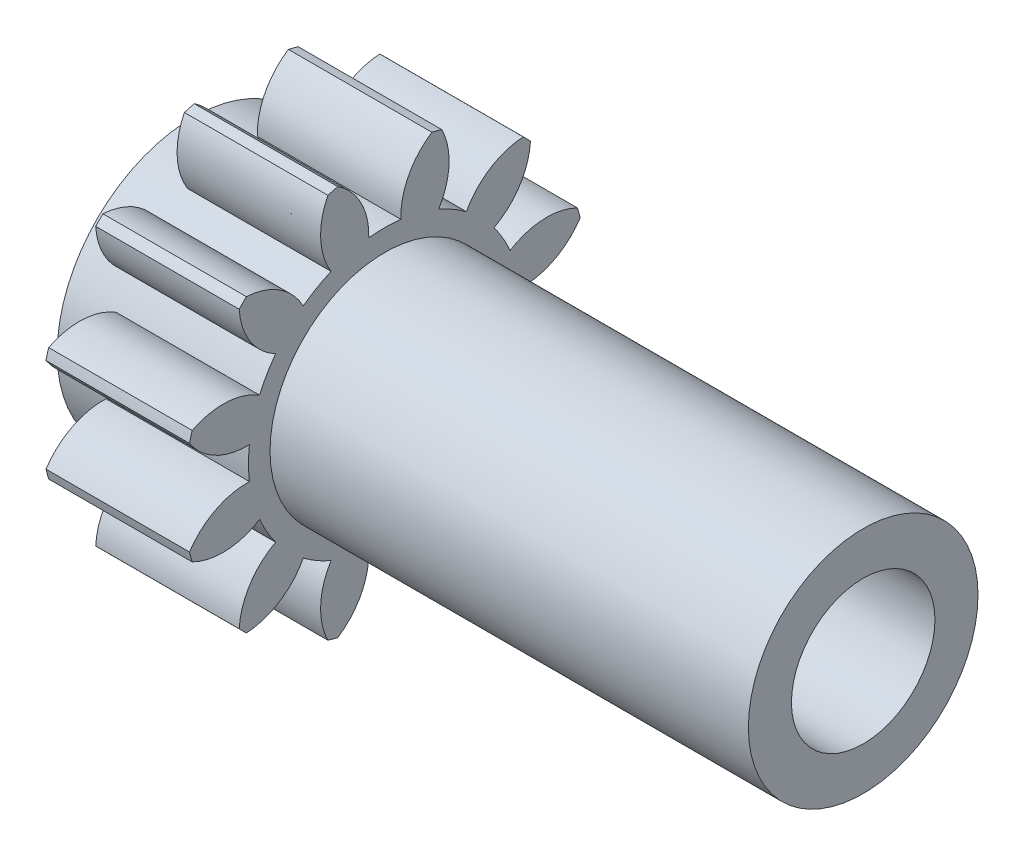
ISO-10303-21;
HEADER;
FILE_DESCRIPTION(('STEP AP214'),'2;1');
FILE_NAME('part.step','',(''),(''),'','','');
FILE_SCHEMA(('AUTOMOTIVE_DESIGN { 1 0 10303 214 1 1 1 1 }'));
ENDSEC;
DATA;
#1=APPLICATION_CONTEXT('core data for automotive mechanical design processes');
#2=APPLICATION_PROTOCOL_DEFINITION('international standard','automotive_design',2000,#1);
#3=PRODUCT_CONTEXT('',#1,'mechanical');
#4=PRODUCT('Part','Part','',(#3));
#5=PRODUCT_RELATED_PRODUCT_CATEGORY('part','',(#4));
#6=PRODUCT_DEFINITION_FORMATION('','',#4);
#7=PRODUCT_DEFINITION_CONTEXT('part definition',#1,'design');
#8=PRODUCT_DEFINITION('design','',#6,#7);
#9=PRODUCT_DEFINITION_SHAPE('','',#8);
#10=(LENGTH_UNIT() NAMED_UNIT(*) SI_UNIT(.MILLI.,.METRE.));
#11=(NAMED_UNIT(*) PLANE_ANGLE_UNIT() SI_UNIT($,.RADIAN.));
#12=(NAMED_UNIT(*) SI_UNIT($,.STERADIAN.) SOLID_ANGLE_UNIT());
#13=UNCERTAINTY_MEASURE_WITH_UNIT(LENGTH_MEASURE(1.E-05),#10,'distance_accuracy_value','');
#14=(GEOMETRIC_REPRESENTATION_CONTEXT(3) GLOBAL_UNCERTAINTY_ASSIGNED_CONTEXT((#13)) GLOBAL_UNIT_ASSIGNED_CONTEXT((#10,
#11,#12)) REPRESENTATION_CONTEXT('',''));
#15=CARTESIAN_POINT('',(0.,0.,0.));
#16=DIRECTION('',(0.,0.,1.));
#17=DIRECTION('',(1.,0.,0.));
#18=AXIS2_PLACEMENT_3D('',#15,#16,#17);
#19=CARTESIAN_POINT('',(15.,0.,0.));
#20=DIRECTION('',(-1.,0.,0.));
#21=DIRECTION('',(0.,0.,1.));
#22=AXIS2_PLACEMENT_3D('',#19,#20,#21);
#23=PLANE('',#22);
#24=CARTESIAN_POINT('',(15.,14.8841159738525,8.03506636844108));
#25=DIRECTION('',(-1.,0.,0.));
#26=DIRECTION('',(0.,0.86602540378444,-0.499999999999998));
#27=AXIS2_PLACEMENT_3D('',#24,#25,#26);
#28=CIRCLE('',#27,7.20000000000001);
#29=CARTESIAN_POINT('',(15.,8.52719159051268,11.4158225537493));
#30=VERTEX_POINT('',#29);
#31=CARTESIAN_POINT('',(15.,14.4659244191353,15.2229113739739));
#32=VERTEX_POINT('',#31);
#33=EDGE_CURVE('E365',#30,#32,#28,.T.);
#34=ORIENTED_EDGE('',*,*,#33,.F.);
#35=CARTESIAN_POINT('',(15.,0.,0.));
#36=DIRECTION('',(-1.,0.,0.));
#37=DIRECTION('',(0.,0.86602540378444,-0.499999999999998));
#38=AXIS2_PLACEMENT_3D('',#35,#36,#37);
#39=CIRCLE('',#38,14.249);
#40=CARTESIAN_POINT('',(15.,5.62279654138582,13.0926758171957));
#41=VERTEX_POINT('',#40);
#42=EDGE_CURVE('E353',#41,#30,#39,.T.);
#43=ORIENTED_EDGE('',*,*,#42,.F.);
#44=CARTESIAN_POINT('',(15.,-0.483486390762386,16.9075557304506));
#45=DIRECTION('',(-1.,0.,0.));
#46=DIRECTION('',(0.,0.86602540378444,-0.499999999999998));
#47=AXIS2_PLACEMENT_3D('',#44,#45,#46);
#48=CIRCLE('',#47,7.20000000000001);
#49=CARTESIAN_POINT('',(15.,5.95046575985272,20.1393137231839));
#50=VERTEX_POINT('',#49);
#51=EDGE_CURVE('E383',#50,#41,#48,.T.);
#52=ORIENTED_EDGE('',*,*,#51,.F.);
#53=CARTESIAN_POINT('',(15.,0.,0.));
#54=DIRECTION('',(-1.,0.,0.));
#55=DIRECTION('',(0.,0.,1.));
#56=AXIS2_PLACEMENT_3D('',#53,#54,#55);
#57=CIRCLE('',#56,21.);
#58=CARTESIAN_POINT('',(15.,4.91640234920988,20.4163901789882));
#59=VERTEX_POINT('',#58);
#60=EDGE_CURVE('E737',#59,#50,#57,.T.);
#61=ORIENTED_EDGE('',*,*,#60,.F.);
#62=CARTESIAN_POINT('',(15.,8.87248936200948,14.4006295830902));
#63=DIRECTION('',(-1.,0.,0.));
#64=DIRECTION('',(0.,1.,0.));
#65=AXIS2_PLACEMENT_3D('',#62,#63,#64);
#66=CIRCLE('',#65,7.20000000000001);
#67=CARTESIAN_POINT('',(15.,1.67685326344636,14.1499881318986));
#68=VERTEX_POINT('',#67);
#69=EDGE_CURVE('E388',#68,#59,#66,.T.);
#70=ORIENTED_EDGE('',*,*,#69,.F.);
#71=CARTESIAN_POINT('',(15.,0.,0.));
#72=DIRECTION('',(-1.,0.,0.));
#73=DIRECTION('',(0.,1.,0.));
#74=AXIS2_PLACEMENT_3D('',#71,#72,#73);
#75=CIRCLE('',#74,14.249);
#76=CARTESIAN_POINT('',(15.,-1.67685326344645,14.1499881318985));
#77=VERTEX_POINT('',#76);
#78=EDGE_CURVE('E393',#77,#68,#75,.T.);
#79=ORIENTED_EDGE('',*,*,#78,.F.);
#80=CARTESIAN_POINT('',(15.,-8.87248936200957,14.4006295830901));
#81=DIRECTION('',(-1.,0.,0.));
#82=DIRECTION('',(0.,1.,0.));
#83=AXIS2_PLACEMENT_3D('',#80,#81,#82);
#84=CIRCLE('',#83,7.20000000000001);
#85=CARTESIAN_POINT('',(15.,-4.91640234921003,20.4163901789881));
#86=VERTEX_POINT('',#85);
#87=EDGE_CURVE('E390',#86,#77,#84,.T.);
#88=ORIENTED_EDGE('',*,*,#87,.F.);
#89=CARTESIAN_POINT('',(15.,-5.95046575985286,20.1393137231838));
#90=VERTEX_POINT('',#89);
#91=EDGE_CURVE('E718',#90,#86,#57,.T.);
#92=ORIENTED_EDGE('',*,*,#91,.F.);
#93=CARTESIAN_POINT('',(15.,0.48348639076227,16.9075557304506));
#94=DIRECTION('',(-1.,0.,0.));
#95=DIRECTION('',(0.,0.866025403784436,0.500000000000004));
#96=AXIS2_PLACEMENT_3D('',#93,#94,#95);
#97=CIRCLE('',#96,7.20000000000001);
#98=CARTESIAN_POINT('',(15.,-5.62279654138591,13.0926758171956));
#99=VERTEX_POINT('',#98);
#100=EDGE_CURVE('E430',#99,#90,#97,.T.);
#101=ORIENTED_EDGE('',*,*,#100,.F.);
#102=CARTESIAN_POINT('',(15.,0.,0.));
#103=DIRECTION('',(-1.,0.,0.));
#104=DIRECTION('',(0.,0.866025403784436,0.500000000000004));
#105=AXIS2_PLACEMENT_3D('',#102,#103,#104);
#106=CIRCLE('',#105,14.249);
#107=CARTESIAN_POINT('',(15.,-8.52719159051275,11.4158225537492));
#108=VERTEX_POINT('',#107);
#109=EDGE_CURVE('E434',#108,#99,#106,.T.);
#110=ORIENTED_EDGE('',*,*,#109,.F.);
#111=CARTESIAN_POINT('',(15.,-14.8841159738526,8.03506636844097));
#112=DIRECTION('',(-1.,0.,0.));
#113=DIRECTION('',(0.,0.866025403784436,0.500000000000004));
#114=AXIS2_PLACEMENT_3D('',#111,#112,#113);
#115=CIRCLE('',#114,7.20000000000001);
#116=CARTESIAN_POINT('',(15.,-14.4659244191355,15.2229113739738));
#117=VERTEX_POINT('',#116);
#118=EDGE_CURVE('E432',#117,#108,#115,.T.);
#119=ORIENTED_EDGE('',*,*,#118,.F.);
#120=CARTESIAN_POINT('',(15.,-15.222911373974,14.4659244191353));
#121=VERTEX_POINT('',#120);
#122=EDGE_CURVE('E739',#121,#117,#57,.T.);
#123=ORIENTED_EDGE('',*,*,#122,.F.);
#124=CARTESIAN_POINT('',(15.,-8.03506636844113,14.8841159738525));
#125=DIRECTION('',(-1.,0.,0.));
#126=DIRECTION('',(0.,0.499999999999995,0.866025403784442));
#127=AXIS2_PLACEMENT_3D('',#124,#125,#126);
#128=CIRCLE('',#127,7.20000000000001);
#129=CARTESIAN_POINT('',(15.,-11.4158225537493,8.52719159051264));
#130=VERTEX_POINT('',#129);
#131=EDGE_CURVE('E401',#130,#121,#128,.T.);
#132=ORIENTED_EDGE('',*,*,#131,.F.);
#133=CARTESIAN_POINT('',(15.,0.,0.));
#134=DIRECTION('',(-1.,0.,0.));
#135=DIRECTION('',(0.,0.499999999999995,0.866025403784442));
#136=AXIS2_PLACEMENT_3D('',#133,#134,#135);
#137=CIRCLE('',#136,14.249);
#138=CARTESIAN_POINT('',(15.,-13.0926758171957,5.62279654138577));
#139=VERTEX_POINT('',#138);
#140=EDGE_CURVE('E406',#139,#130,#137,.T.);
#141=ORIENTED_EDGE('',*,*,#140,.F.);
#142=CARTESIAN_POINT('',(15.,-16.9075557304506,-0.483486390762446));
#143=DIRECTION('',(-1.,0.,0.));
#144=DIRECTION('',(0.,0.499999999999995,0.866025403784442));
#145=AXIS2_PLACEMENT_3D('',#142,#143,#144);
#146=CIRCLE('',#145,7.20000000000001);
#147=CARTESIAN_POINT('',(15.,-20.1393137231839,5.95046575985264));
#148=VERTEX_POINT('',#147);
#149=EDGE_CURVE('E403',#148,#139,#146,.T.);
#150=ORIENTED_EDGE('',*,*,#149,.F.);
#151=CARTESIAN_POINT('',(15.,-20.4163901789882,4.9164023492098));
#152=VERTEX_POINT('',#151);
#153=EDGE_CURVE('E769',#152,#148,#57,.T.);
#154=ORIENTED_EDGE('',*,*,#153,.F.);
#155=CARTESIAN_POINT('',(15.,-14.4006295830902,8.87248936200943));
#156=DIRECTION('',(-1.,0.,0.));
#157=DIRECTION('',(0.,0.,1.));
#158=AXIS2_PLACEMENT_3D('',#155,#156,#157);
#159=CIRCLE('',#158,7.20000000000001);
#160=CARTESIAN_POINT('',(15.,-14.1499881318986,1.67685326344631));
#161=VERTEX_POINT('',#160);
#162=EDGE_CURVE('E417',#161,#152,#159,.T.);
#163=ORIENTED_EDGE('',*,*,#162,.F.);
#164=CARTESIAN_POINT('',(15.,0.,0.));
#165=DIRECTION('',(-1.,0.,0.));
#166=DIRECTION('',(0.,0.,1.));
#167=AXIS2_PLACEMENT_3D('',#164,#165,#166);
#168=CIRCLE('',#167,14.249);
#169=CARTESIAN_POINT('',(15.,-14.1499881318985,-1.6768532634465));
#170=VERTEX_POINT('',#169);
#171=EDGE_CURVE('E422',#170,#161,#168,.T.);
#172=ORIENTED_EDGE('',*,*,#171,.F.);
#173=CARTESIAN_POINT('',(15.,-14.4006295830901,-8.87248936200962));
#174=DIRECTION('',(-1.,0.,0.));
#175=DIRECTION('',(0.,0.,1.));
#176=AXIS2_PLACEMENT_3D('',#173,#174,#175);
#177=CIRCLE('',#176,7.20000000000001);
#178=CARTESIAN_POINT('',(15.,-20.4163901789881,-4.9164023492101));
#179=VERTEX_POINT('',#178);
#180=EDGE_CURVE('E419',#179,#170,#177,.T.);
#181=ORIENTED_EDGE('',*,*,#180,.F.);
#182=CARTESIAN_POINT('',(15.,-20.1393137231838,-5.95046575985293));
#183=VERTEX_POINT('',#182);
#184=EDGE_CURVE('E763',#183,#179,#57,.T.);
#185=ORIENTED_EDGE('',*,*,#184,.F.);
#186=CARTESIAN_POINT('',(15.,-16.9075557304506,0.483486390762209));
#187=DIRECTION('',(-1.,0.,0.));
#188=DIRECTION('',(0.,-0.500000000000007,0.866025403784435));
#189=AXIS2_PLACEMENT_3D('',#186,#187,#188);
#190=CIRCLE('',#189,7.20000000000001);
#191=CARTESIAN_POINT('',(15.,-13.0926758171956,-5.62279654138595));
#192=VERTEX_POINT('',#191);
#193=EDGE_CURVE('E458',#192,#183,#190,.T.);
#194=ORIENTED_EDGE('',*,*,#193,.F.);
#195=CARTESIAN_POINT('',(15.,0.,0.));
#196=DIRECTION('',(-1.,0.,0.));
#197=DIRECTION('',(0.,-0.500000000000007,0.866025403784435));
#198=AXIS2_PLACEMENT_3D('',#195,#196,#197);
#199=CIRCLE('',#198,14.249);
#200=CARTESIAN_POINT('',(15.,-11.4158225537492,-8.52719159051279));
#201=VERTEX_POINT('',#200);
#202=EDGE_CURVE('E462',#201,#192,#199,.T.);
#203=ORIENTED_EDGE('',*,*,#202,.F.);
#204=CARTESIAN_POINT('',(15.,-8.03506636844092,-14.8841159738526));
#205=DIRECTION('',(-1.,0.,0.));
#206=DIRECTION('',(0.,-0.500000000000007,0.866025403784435));
#207=AXIS2_PLACEMENT_3D('',#204,#205,#206);
#208=CIRCLE('',#207,7.20000000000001);
#209=CARTESIAN_POINT('',(15.,-15.2229113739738,-14.4659244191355));
#210=VERTEX_POINT('',#209);
#211=EDGE_CURVE('E460',#210,#201,#208,.T.);
#212=ORIENTED_EDGE('',*,*,#211,.F.);
#213=CARTESIAN_POINT('',(15.,-14.4659244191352,-15.222911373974));
#214=VERTEX_POINT('',#213);
#215=EDGE_CURVE('E757',#214,#210,#57,.T.);
#216=ORIENTED_EDGE('',*,*,#215,.F.);
#217=CARTESIAN_POINT('',(15.,-14.8841159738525,-8.03506636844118));
#218=DIRECTION('',(-1.,0.,0.));
#219=DIRECTION('',(0.,-0.866025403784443,0.499999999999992));
#220=AXIS2_PLACEMENT_3D('',#217,#218,#219);
#221=CIRCLE('',#220,7.20000000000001);
#222=CARTESIAN_POINT('',(15.,-8.5271915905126,-11.4158225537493));
#223=VERTEX_POINT('',#222);
#224=EDGE_CURVE('E442',#223,#214,#221,.T.);
#225=ORIENTED_EDGE('',*,*,#224,.F.);
#226=CARTESIAN_POINT('',(15.,0.,0.));
#227=DIRECTION('',(-1.,0.,0.));
#228=DIRECTION('',(0.,-0.866025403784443,0.499999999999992));
#229=AXIS2_PLACEMENT_3D('',#226,#227,#228);
#230=CIRCLE('',#229,14.249);
#231=CARTESIAN_POINT('',(15.,-5.62279654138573,-13.0926758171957));
#232=VERTEX_POINT('',#231);
#233=EDGE_CURVE('E447',#232,#223,#230,.T.);
#234=ORIENTED_EDGE('',*,*,#233,.F.);
#235=CARTESIAN_POINT('',(15.,0.483486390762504,-16.9075557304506));
#236=DIRECTION('',(-1.,0.,0.));
#237=DIRECTION('',(0.,-0.866025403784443,0.499999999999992));
#238=AXIS2_PLACEMENT_3D('',#235,#236,#237);
#239=CIRCLE('',#238,7.20000000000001);
#240=CARTESIAN_POINT('',(15.,-5.95046575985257,-20.1393137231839));
#241=VERTEX_POINT('',#240);
#242=EDGE_CURVE('E444',#241,#232,#239,.T.);
#243=ORIENTED_EDGE('',*,*,#242,.F.);
#244=CARTESIAN_POINT('',(15.,-4.91640234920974,-20.4163901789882));
#245=VERTEX_POINT('',#244);
#246=EDGE_CURVE('E751',#245,#241,#57,.T.);
#247=ORIENTED_EDGE('',*,*,#246,.F.);
#248=CARTESIAN_POINT('',(15.,-8.87248936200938,-14.4006295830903));
#249=DIRECTION('',(-1.,0.,0.));
#250=DIRECTION('',(0.,-1.,0.));
#251=AXIS2_PLACEMENT_3D('',#248,#249,#250);
#252=CIRCLE('',#251,7.20000000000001);
#253=CARTESIAN_POINT('',(15.,-1.67685326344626,-14.1499881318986));
#254=VERTEX_POINT('',#253);
#255=EDGE_CURVE('E470',#254,#245,#252,.T.);
#256=ORIENTED_EDGE('',*,*,#255,.F.);
#257=CARTESIAN_POINT('',(15.,0.,0.));
#258=DIRECTION('',(-1.,0.,0.));
#259=DIRECTION('',(0.,-1.,0.));
#260=AXIS2_PLACEMENT_3D('',#257,#258,#259);
#261=CIRCLE('',#260,14.249);
#262=CARTESIAN_POINT('',(15.,1.67685326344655,-14.1499881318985));
#263=VERTEX_POINT('',#262);
#264=EDGE_CURVE('E475',#263,#254,#261,.T.);
#265=ORIENTED_EDGE('',*,*,#264,.F.);
#266=CARTESIAN_POINT('',(15.,8.87248936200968,-14.4006295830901));
#267=DIRECTION('',(-1.,0.,0.));
#268=DIRECTION('',(0.,-1.,0.));
#269=AXIS2_PLACEMENT_3D('',#266,#267,#268);
#270=CIRCLE('',#269,7.20000000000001);
#271=CARTESIAN_POINT('',(15.,4.91640234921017,-20.4163901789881));
#272=VERTEX_POINT('',#271);
#273=EDGE_CURVE('E472',#272,#263,#270,.T.);
#274=ORIENTED_EDGE('',*,*,#273,.F.);
#275=CARTESIAN_POINT('',(15.,5.950465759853,-20.1393137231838));
#276=VERTEX_POINT('',#275);
#277=EDGE_CURVE('E745',#276,#272,#57,.T.);
#278=ORIENTED_EDGE('',*,*,#277,.F.);
#279=CARTESIAN_POINT('',(15.,-0.48348639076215,-16.9075557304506));
#280=DIRECTION('',(-1.,0.,0.));
#281=DIRECTION('',(0.,-0.866025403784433,-0.50000000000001));
#282=AXIS2_PLACEMENT_3D('',#279,#280,#281);
#283=CIRCLE('',#282,7.20000000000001);
#284=CARTESIAN_POINT('',(15.,5.622796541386,-13.0926758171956));
#285=VERTEX_POINT('',#284);
#286=EDGE_CURVE('E498',#285,#276,#283,.T.);
#287=ORIENTED_EDGE('',*,*,#286,.F.);
#288=CARTESIAN_POINT('',(15.,0.,0.));
#289=DIRECTION('',(-1.,0.,0.));
#290=DIRECTION('',(0.,-0.866025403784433,-0.50000000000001));
#291=AXIS2_PLACEMENT_3D('',#288,#289,#290);
#292=CIRCLE('',#291,14.249);
#293=CARTESIAN_POINT('',(15.,8.52719159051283,-11.4158225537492));
#294=VERTEX_POINT('',#293);
#295=EDGE_CURVE('E502',#294,#285,#292,.T.);
#296=ORIENTED_EDGE('',*,*,#295,.F.);
#297=CARTESIAN_POINT('',(15.,14.8841159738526,-8.03506636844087));
#298=DIRECTION('',(-1.,0.,0.));
#299=DIRECTION('',(0.,-0.866025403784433,-0.50000000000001));
#300=AXIS2_PLACEMENT_3D('',#297,#298,#299);
#301=CIRCLE('',#300,7.20000000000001);
#302=CARTESIAN_POINT('',(15.,14.4659244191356,-15.2229113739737));
#303=VERTEX_POINT('',#302);
#304=EDGE_CURVE('E500',#303,#294,#301,.T.);
#305=ORIENTED_EDGE('',*,*,#304,.F.);
#306=CARTESIAN_POINT('',(15.,15.2229113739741,-14.4659244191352));
#307=VERTEX_POINT('',#306);
#308=EDGE_CURVE('E596',#307,#303,#57,.T.);
#309=ORIENTED_EDGE('',*,*,#308,.F.);
#310=CARTESIAN_POINT('',(15.,8.03506636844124,-14.8841159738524));
#311=DIRECTION('',(-1.,0.,0.));
#312=DIRECTION('',(0.,-0.499999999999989,-0.866025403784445));
#313=AXIS2_PLACEMENT_3D('',#310,#311,#312);
#314=CIRCLE('',#313,7.20000000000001);
#315=CARTESIAN_POINT('',(15.,11.4158225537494,-8.52719159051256));
#316=VERTEX_POINT('',#315);
#317=EDGE_CURVE('E484',#316,#307,#314,.T.);
#318=ORIENTED_EDGE('',*,*,#317,.F.);
#319=CARTESIAN_POINT('',(15.,0.,0.));
#320=DIRECTION('',(-1.,0.,0.));
#321=DIRECTION('',(0.,-0.499999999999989,-0.866025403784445));
#322=AXIS2_PLACEMENT_3D('',#319,#320,#321);
#323=CIRCLE('',#322,14.249);
#324=CARTESIAN_POINT('',(15.,13.0926758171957,-5.62279654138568));
#325=VERTEX_POINT('',#324);
#326=EDGE_CURVE('E488',#325,#316,#323,.T.);
#327=ORIENTED_EDGE('',*,*,#326,.F.);
#328=CARTESIAN_POINT('',(15.,16.9075557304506,0.483486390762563));
#329=DIRECTION('',(-1.,0.,0.));
#330=DIRECTION('',(0.,-0.499999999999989,-0.866025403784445));
#331=AXIS2_PLACEMENT_3D('',#328,#329,#330);
#332=CIRCLE('',#331,7.20000000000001);
#333=CARTESIAN_POINT('',(15.,20.1393137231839,-5.9504657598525));
#334=VERTEX_POINT('',#333);
#335=EDGE_CURVE('E486',#334,#325,#332,.T.);
#336=ORIENTED_EDGE('',*,*,#335,.F.);
#337=CARTESIAN_POINT('',(15.,20.4163901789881,-4.91640234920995));
#338=VERTEX_POINT('',#337);
#339=EDGE_CURVE('E592',#338,#334,#57,.T.);
#340=ORIENTED_EDGE('',*,*,#339,.F.);
#341=CARTESIAN_POINT('',(15.,14.4006295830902,-8.87248936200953));
#342=DIRECTION('',(-1.,0.,0.));
#343=DIRECTION('',(0.,0.,-1.));
#344=AXIS2_PLACEMENT_3D('',#341,#342,#343);
#345=CIRCLE('',#344,7.20000000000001);
#346=CARTESIAN_POINT('',(15.,14.1499881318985,-1.67685326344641));
#347=VERTEX_POINT('',#346);
#348=EDGE_CURVE('E568',#347,#338,#345,.T.);
#349=ORIENTED_EDGE('',*,*,#348,.F.);
#350=CARTESIAN_POINT('',(15.,0.,0.));
#351=DIRECTION('',(-1.,0.,0.));
#352=DIRECTION('',(0.,0.,-1.));
#353=AXIS2_PLACEMENT_3D('',#350,#351,#352);
#354=CIRCLE('',#353,14.249);
#355=CARTESIAN_POINT('',(15.,14.1499881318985,1.6768532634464));
#356=VERTEX_POINT('',#355);
#357=EDGE_CURVE('E572',#356,#347,#354,.T.);
#358=ORIENTED_EDGE('',*,*,#357,.F.);
#359=CARTESIAN_POINT('',(15.,14.4006295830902,8.87248936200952));
#360=DIRECTION('',(-1.,0.,0.));
#361=DIRECTION('',(0.,0.,-1.));
#362=AXIS2_PLACEMENT_3D('',#359,#360,#361);
#363=CIRCLE('',#362,7.20000000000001);
#364=CARTESIAN_POINT('',(15.,20.4163901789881,4.91640234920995));
#365=VERTEX_POINT('',#364);
#366=EDGE_CURVE('E570',#365,#356,#363,.T.);
#367=ORIENTED_EDGE('',*,*,#366,.F.);
#368=CARTESIAN_POINT('',(15.,20.1393137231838,5.95046575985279));
#369=VERTEX_POINT('',#368);
#370=EDGE_CURVE('E589',#369,#365,#57,.T.);
#371=ORIENTED_EDGE('',*,*,#370,.F.);
#372=CARTESIAN_POINT('',(15.,16.9075557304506,-0.483486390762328));
#373=DIRECTION('',(-1.,0.,0.));
#374=DIRECTION('',(0.,0.500000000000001,-0.866025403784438));
#375=AXIS2_PLACEMENT_3D('',#372,#373,#374);
#376=CIRCLE('',#375,7.20000000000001);
#377=CARTESIAN_POINT('',(15.,13.0926758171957,5.62279654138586));
#378=VERTEX_POINT('',#377);
#379=EDGE_CURVE('E549',#378,#369,#376,.T.);
#380=ORIENTED_EDGE('',*,*,#379,.F.);
#381=CARTESIAN_POINT('',(15.,0.,0.));
#382=DIRECTION('',(-1.,0.,0.));
#383=DIRECTION('',(0.,0.500000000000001,-0.866025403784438));
#384=AXIS2_PLACEMENT_3D('',#381,#382,#383);
#385=CIRCLE('',#384,14.249);
#386=CARTESIAN_POINT('',(15.,11.4158225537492,8.52719159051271));
#387=VERTEX_POINT('',#386);
#388=EDGE_CURVE('E553',#387,#378,#385,.T.);
#389=ORIENTED_EDGE('',*,*,#388,.F.);
#390=CARTESIAN_POINT('',(15.,8.03506636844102,14.8841159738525));
#391=DIRECTION('',(-1.,0.,0.));
#392=DIRECTION('',(0.,0.500000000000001,-0.866025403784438));
#393=AXIS2_PLACEMENT_3D('',#390,#391,#392);
#394=CIRCLE('',#393,7.20000000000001);
#395=CARTESIAN_POINT('',(15.,15.2229113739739,14.4659244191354));
#396=VERTEX_POINT('',#395);
#397=EDGE_CURVE('E551',#396,#387,#394,.T.);
#398=ORIENTED_EDGE('',*,*,#397,.F.);
#399=EDGE_CURVE('E597',#32,#396,#57,.T.);
#400=ORIENTED_EDGE('',*,*,#399,.F.);
#401=EDGE_LOOP('',(#34,#43,#52,#61,#70,#79,#88,#92,#101,#110,#119,#123,#132,#141,#150,#154,#163,
#172,#181,#185,#194,#203,#212,#216,#225,#234,#243,#247,#256,#265,#274,#278,#287,#296,#305,#309,
#318,#327,#336,#340,#349,#358,#367,#371,#380,#389,#398,#400));
#402=FACE_BOUND('',#401,.T.);
#403=CARTESIAN_POINT('',(15.,0.,0.));
#404=DIRECTION('',(-1.,0.,0.));
#405=DIRECTION('',(0.,0.,1.));
#406=AXIS2_PLACEMENT_3D('',#403,#404,#405);
#407=CIRCLE('',#406,12.);
#408=CARTESIAN_POINT('',(15.,0.,12.));
#409=VERTEX_POINT('',#408);
#410=EDGE_CURVE('E11',#409,#409,#407,.F.);
#411=ORIENTED_EDGE('',*,*,#410,.F.);
#412=EDGE_LOOP('',(#411));
#413=FACE_BOUND('',#412,.T.);
#414=ADVANCED_FACE('F35',(#402,#413),#23,.F.);
#415=CARTESIAN_POINT('',(15.,0.,0.));
#416=DIRECTION('',(-1.,0.,0.));
#417=DIRECTION('',(0.,0.,1.));
#418=AXIS2_PLACEMENT_3D('',#415,#416,#417);
#419=CYLINDRICAL_SURFACE('',#418,14.249);
#420=DIRECTION('',(-1.,0.,0.));
#421=VECTOR('',#420,1.);
#422=CARTESIAN_POINT('',(15.,14.1499881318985,-1.67685326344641));
#423=LINE('',#422,#421);
#424=CARTESIAN_POINT('',(0.,14.1499881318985,-1.67685326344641));
#425=VERTEX_POINT('',#424);
#426=EDGE_CURVE('E574',#347,#425,#423,.T.);
#427=ORIENTED_EDGE('',*,*,#426,.T.);
#428=CARTESIAN_POINT('',(0.,0.,0.));
#429=DIRECTION('',(-1.,0.,0.));
#430=DIRECTION('',(0.,0.,1.));
#431=AXIS2_PLACEMENT_3D('',#428,#429,#430);
#432=CIRCLE('',#431,14.249);
#433=CARTESIAN_POINT('',(0.,13.0926758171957,-5.62279654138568));
#434=VERTEX_POINT('',#433);
#435=EDGE_CURVE('E377',#425,#434,#432,.T.);
#436=ORIENTED_EDGE('',*,*,#435,.T.);
#437=DIRECTION('',(-1.,0.,0.));
#438=VECTOR('',#437,1.);
#439=CARTESIAN_POINT('',(15.,13.0926758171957,-5.62279654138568));
#440=LINE('',#439,#438);
#441=EDGE_CURVE('E495',#325,#434,#440,.T.);
#442=ORIENTED_EDGE('',*,*,#441,.F.);
#443=ORIENTED_EDGE('',*,*,#326,.T.);
#444=DIRECTION('',(-1.,0.,0.));
#445=VECTOR('',#444,1.);
#446=CARTESIAN_POINT('',(15.,11.4158225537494,-8.52719159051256));
#447=LINE('',#446,#445);
#448=CARTESIAN_POINT('',(0.,11.4158225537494,-8.52719159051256));
#449=VERTEX_POINT('',#448);
#450=EDGE_CURVE('E490',#316,#449,#447,.T.);
#451=ORIENTED_EDGE('',*,*,#450,.T.);
#452=CARTESIAN_POINT('',(0.,8.52719159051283,-11.4158225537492));
#453=VERTEX_POINT('',#452);
#454=EDGE_CURVE('E808',#449,#453,#432,.T.);
#455=ORIENTED_EDGE('',*,*,#454,.T.);
#456=DIRECTION('',(-1.,0.,0.));
#457=VECTOR('',#456,1.);
#458=CARTESIAN_POINT('',(15.,8.52719159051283,-11.4158225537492));
#459=LINE('',#458,#457);
#460=EDGE_CURVE('E480',#294,#453,#459,.T.);
#461=ORIENTED_EDGE('',*,*,#460,.F.);
#462=ORIENTED_EDGE('',*,*,#295,.T.);
#463=DIRECTION('',(-1.,0.,0.));
#464=VECTOR('',#463,1.);
#465=CARTESIAN_POINT('',(15.,5.622796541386,-13.0926758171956));
#466=LINE('',#465,#464);
#467=CARTESIAN_POINT('',(0.,5.622796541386,-13.0926758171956));
#468=VERTEX_POINT('',#467);
#469=EDGE_CURVE('E504',#285,#468,#466,.T.);
#470=ORIENTED_EDGE('',*,*,#469,.T.);
#471=CARTESIAN_POINT('',(0.,1.67685326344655,-14.1499881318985));
#472=VERTEX_POINT('',#471);
#473=EDGE_CURVE('E805',#468,#472,#432,.T.);
#474=ORIENTED_EDGE('',*,*,#473,.T.);
#475=DIRECTION('',(-1.,0.,0.));
#476=VECTOR('',#475,1.);
#477=CARTESIAN_POINT('',(15.,1.67685326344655,-14.1499881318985));
#478=LINE('',#477,#476);
#479=EDGE_CURVE('E452',#263,#472,#478,.T.);
#480=ORIENTED_EDGE('',*,*,#479,.F.);
#481=ORIENTED_EDGE('',*,*,#264,.T.);
#482=DIRECTION('',(-1.,0.,0.));
#483=VECTOR('',#482,1.);
#484=CARTESIAN_POINT('',(15.,-1.67685326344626,-14.1499881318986));
#485=LINE('',#484,#483);
#486=CARTESIAN_POINT('',(0.,-1.67685326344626,-14.1499881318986));
#487=VERTEX_POINT('',#486);
#488=EDGE_CURVE('E477',#254,#487,#485,.T.);
#489=ORIENTED_EDGE('',*,*,#488,.T.);
#490=CARTESIAN_POINT('',(0.,-5.62279654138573,-13.0926758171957));
#491=VERTEX_POINT('',#490);
#492=EDGE_CURVE('E802',#487,#491,#432,.T.);
#493=ORIENTED_EDGE('',*,*,#492,.T.);
#494=DIRECTION('',(-1.,0.,0.));
#495=VECTOR('',#494,1.);
#496=CARTESIAN_POINT('',(15.,-5.62279654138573,-13.0926758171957));
#497=LINE('',#496,#495);
#498=EDGE_CURVE('E455',#232,#491,#497,.T.);
#499=ORIENTED_EDGE('',*,*,#498,.F.);
#500=ORIENTED_EDGE('',*,*,#233,.T.);
#501=DIRECTION('',(-1.,0.,0.));
#502=VECTOR('',#501,1.);
#503=CARTESIAN_POINT('',(15.,-8.5271915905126,-11.4158225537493));
#504=LINE('',#503,#502);
#505=CARTESIAN_POINT('',(0.,-8.5271915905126,-11.4158225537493));
#506=VERTEX_POINT('',#505);
#507=EDGE_CURVE('E449',#223,#506,#504,.T.);
#508=ORIENTED_EDGE('',*,*,#507,.T.);
#509=CARTESIAN_POINT('',(0.,-11.4158225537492,-8.52719159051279));
#510=VERTEX_POINT('',#509);
#511=EDGE_CURVE('E799',#506,#510,#432,.T.);
#512=ORIENTED_EDGE('',*,*,#511,.T.);
#513=DIRECTION('',(-1.,0.,0.));
#514=VECTOR('',#513,1.);
#515=CARTESIAN_POINT('',(15.,-11.4158225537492,-8.52719159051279));
#516=LINE('',#515,#514);
#517=EDGE_CURVE('E426',#201,#510,#516,.T.);
#518=ORIENTED_EDGE('',*,*,#517,.F.);
#519=ORIENTED_EDGE('',*,*,#202,.T.);
#520=DIRECTION('',(-1.,0.,0.));
#521=VECTOR('',#520,1.);
#522=CARTESIAN_POINT('',(15.,-13.0926758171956,-5.62279654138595));
#523=LINE('',#522,#521);
#524=CARTESIAN_POINT('',(0.,-13.0926758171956,-5.62279654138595));
#525=VERTEX_POINT('',#524);
#526=EDGE_CURVE('E464',#192,#525,#523,.T.);
#527=ORIENTED_EDGE('',*,*,#526,.T.);
#528=CARTESIAN_POINT('',(0.,-14.1499881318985,-1.6768532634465));
#529=VERTEX_POINT('',#528);
#530=EDGE_CURVE('E796',#525,#529,#432,.T.);
#531=ORIENTED_EDGE('',*,*,#530,.T.);
#532=DIRECTION('',(-1.,0.,0.));
#533=VECTOR('',#532,1.);
#534=CARTESIAN_POINT('',(15.,-14.1499881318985,-1.6768532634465));
#535=LINE('',#534,#533);
#536=EDGE_CURVE('E411',#170,#529,#535,.T.);
#537=ORIENTED_EDGE('',*,*,#536,.F.);
#538=ORIENTED_EDGE('',*,*,#171,.T.);
#539=DIRECTION('',(-1.,0.,0.));
#540=VECTOR('',#539,1.);
#541=CARTESIAN_POINT('',(15.,-14.1499881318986,1.67685326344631));
#542=LINE('',#541,#540);
#543=CARTESIAN_POINT('',(0.,-14.1499881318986,1.67685326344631));
#544=VERTEX_POINT('',#543);
#545=EDGE_CURVE('E424',#161,#544,#542,.T.);
#546=ORIENTED_EDGE('',*,*,#545,.T.);
#547=CARTESIAN_POINT('',(0.,-13.0926758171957,5.62279654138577));
#548=VERTEX_POINT('',#547);
#549=EDGE_CURVE('E57',#544,#548,#432,.T.);
#550=ORIENTED_EDGE('',*,*,#549,.T.);
#551=DIRECTION('',(-1.,0.,0.));
#552=VECTOR('',#551,1.);
#553=CARTESIAN_POINT('',(15.,-13.0926758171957,5.62279654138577));
#554=LINE('',#553,#552);
#555=EDGE_CURVE('E414',#139,#548,#554,.T.);
#556=ORIENTED_EDGE('',*,*,#555,.F.);
#557=ORIENTED_EDGE('',*,*,#140,.T.);
#558=DIRECTION('',(-1.,0.,0.));
#559=VECTOR('',#558,1.);
#560=CARTESIAN_POINT('',(15.,-11.4158225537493,8.52719159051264));
#561=LINE('',#560,#559);
#562=CARTESIAN_POINT('',(0.,-11.4158225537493,8.52719159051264));
#563=VERTEX_POINT('',#562);
#564=EDGE_CURVE('E408',#130,#563,#561,.T.);
#565=ORIENTED_EDGE('',*,*,#564,.T.);
#566=CARTESIAN_POINT('',(0.,-8.52719159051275,11.4158225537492));
#567=VERTEX_POINT('',#566);
#568=EDGE_CURVE('E624',#563,#567,#432,.T.);
#569=ORIENTED_EDGE('',*,*,#568,.T.);
#570=DIRECTION('',(-1.,0.,0.));
#571=VECTOR('',#570,1.);
#572=CARTESIAN_POINT('',(15.,-8.52719159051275,11.4158225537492));
#573=LINE('',#572,#571);
#574=EDGE_CURVE('E397',#108,#567,#573,.T.);
#575=ORIENTED_EDGE('',*,*,#574,.F.);
#576=ORIENTED_EDGE('',*,*,#109,.T.);
#577=DIRECTION('',(-1.,0.,0.));
#578=VECTOR('',#577,1.);
#579=CARTESIAN_POINT('',(15.,-5.62279654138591,13.0926758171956));
#580=LINE('',#579,#578);
#581=CARTESIAN_POINT('',(0.,-5.62279654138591,13.0926758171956));
#582=VERTEX_POINT('',#581);
#583=EDGE_CURVE('E436',#99,#582,#580,.T.);
#584=ORIENTED_EDGE('',*,*,#583,.T.);
#585=CARTESIAN_POINT('',(0.,-1.67685326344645,14.1499881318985));
#586=VERTEX_POINT('',#585);
#587=EDGE_CURVE('E375',#582,#586,#432,.T.);
#588=ORIENTED_EDGE('',*,*,#587,.T.);
#589=DIRECTION('',(-1.,0.,0.));
#590=VECTOR('',#589,1.);
#591=CARTESIAN_POINT('',(15.,-1.67685326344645,14.1499881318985));
#592=LINE('',#591,#590);
#593=EDGE_CURVE('E366',#77,#586,#592,.T.);
#594=ORIENTED_EDGE('',*,*,#593,.F.);
#595=ORIENTED_EDGE('',*,*,#78,.T.);
#596=DIRECTION('',(-1.,0.,0.));
#597=VECTOR('',#596,1.);
#598=CARTESIAN_POINT('',(15.,1.67685326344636,14.1499881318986));
#599=LINE('',#598,#597);
#600=CARTESIAN_POINT('',(0.,1.67685326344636,14.1499881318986));
#601=VERTEX_POINT('',#600);
#602=EDGE_CURVE('E395',#68,#601,#599,.T.);
#603=ORIENTED_EDGE('',*,*,#602,.T.);
#604=CARTESIAN_POINT('',(0.,5.62279654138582,13.0926758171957));
#605=VERTEX_POINT('',#604);
#606=EDGE_CURVE('E49',#601,#605,#432,.T.);
#607=ORIENTED_EDGE('',*,*,#606,.T.);
#608=DIRECTION('',(-1.,0.,0.));
#609=VECTOR('',#608,1.);
#610=CARTESIAN_POINT('',(15.,5.62279654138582,13.0926758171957));
#611=LINE('',#610,#609);
#612=EDGE_CURVE('E356',#41,#605,#611,.T.);
#613=ORIENTED_EDGE('',*,*,#612,.F.);
#614=ORIENTED_EDGE('',*,*,#42,.T.);
#615=DIRECTION('',(-1.,0.,0.));
#616=VECTOR('',#615,1.);
#617=CARTESIAN_POINT('',(15.,8.52719159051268,11.4158225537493));
#618=LINE('',#617,#616);
#619=CARTESIAN_POINT('',(0.,8.52719159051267,11.4158225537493));
#620=VERTEX_POINT('',#619);
#621=EDGE_CURVE('E343',#30,#620,#618,.T.);
#622=ORIENTED_EDGE('',*,*,#621,.T.);
#623=CARTESIAN_POINT('',(0.,11.4158225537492,8.52719159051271));
#624=VERTEX_POINT('',#623);
#625=EDGE_CURVE('E350',#620,#624,#432,.T.);
#626=ORIENTED_EDGE('',*,*,#625,.T.);
#627=DIRECTION('',(-1.,0.,0.));
#628=VECTOR('',#627,1.);
#629=CARTESIAN_POINT('',(15.,11.4158225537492,8.52719159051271));
#630=LINE('',#629,#628);
#631=EDGE_CURVE('E560',#387,#624,#630,.T.);
#632=ORIENTED_EDGE('',*,*,#631,.F.);
#633=ORIENTED_EDGE('',*,*,#388,.T.);
#634=DIRECTION('',(-1.,0.,0.));
#635=VECTOR('',#634,1.);
#636=CARTESIAN_POINT('',(15.,13.0926758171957,5.62279654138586));
#637=LINE('',#636,#635);
#638=CARTESIAN_POINT('',(0.,13.0926758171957,5.62279654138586));
#639=VERTEX_POINT('',#638);
#640=EDGE_CURVE('E555',#378,#639,#637,.T.);
#641=ORIENTED_EDGE('',*,*,#640,.T.);
#642=CARTESIAN_POINT('',(0.,14.1499881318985,1.6768532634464));
#643=VERTEX_POINT('',#642);
#644=EDGE_CURVE('E372',#639,#643,#432,.T.);
#645=ORIENTED_EDGE('',*,*,#644,.T.);
#646=DIRECTION('',(-1.,0.,0.));
#647=VECTOR('',#646,1.);
#648=CARTESIAN_POINT('',(15.,14.1499881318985,1.6768532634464));
#649=LINE('',#648,#647);
#650=EDGE_CURVE('E578',#356,#643,#649,.T.);
#651=ORIENTED_EDGE('',*,*,#650,.F.);
#652=ORIENTED_EDGE('',*,*,#357,.T.);
#653=EDGE_LOOP('',(#427,#436,#442,#443,#451,#455,#461,#462,#470,#474,#480,#481,#489,#493,#499,
#500,#508,#512,#518,#519,#527,#531,#537,#538,#546,#550,#556,#557,#565,#569,#575,#576,#584,#588,
#594,#595,#603,#607,#613,#614,#622,#626,#632,#633,#641,#645,#651,#652));
#654=FACE_BOUND('',#653,.T.);
#655=CARTESIAN_POINT('',(-5.0000508,0.,0.));
#656=DIRECTION('',(-1.,0.,0.));
#657=DIRECTION('',(0.,0.,1.));
#658=AXIS2_PLACEMENT_3D('',#655,#656,#657);
#659=CIRCLE('',#658,14.249);
#660=CARTESIAN_POINT('',(-5.0000508,0.,14.249));
#661=VERTEX_POINT('',#660);
#662=EDGE_CURVE('E380',#661,#661,#659,.T.);
#663=ORIENTED_EDGE('',*,*,#662,.F.);
#664=EDGE_LOOP('',(#663));
#665=FACE_BOUND('',#664,.T.);
#666=ADVANCED_FACE('F346',(#654,#665),#419,.T.);
#667=CARTESIAN_POINT('',(50.0000508,0.,0.));
#668=DIRECTION('',(-1.,0.,0.));
#669=DIRECTION('',(0.,0.,1.));
#670=AXIS2_PLACEMENT_3D('',#667,#668,#669);
#671=CYLINDRICAL_SURFACE('',#670,7.5);
#672=CARTESIAN_POINT('',(-5.0000508,0.,0.));
#673=DIRECTION('',(-1.,0.,0.));
#674=DIRECTION('',(0.,0.,1.));
#675=AXIS2_PLACEMENT_3D('',#672,#673,#674);
#676=CIRCLE('',#675,7.5);
#677=CARTESIAN_POINT('',(-5.0000508,0.,7.5));
#678=VERTEX_POINT('',#677);
#679=EDGE_CURVE('E619',#678,#678,#676,.T.);
#680=ORIENTED_EDGE('',*,*,#679,.T.);
#681=EDGE_LOOP('',(#680));
#682=FACE_BOUND('',#681,.T.);
#683=CARTESIAN_POINT('',(65.,0.,0.));
#684=DIRECTION('',(1.,0.,0.));
#685=DIRECTION('',(0.,0.,-1.));
#686=AXIS2_PLACEMENT_3D('',#683,#684,#685);
#687=CIRCLE('',#686,7.5);
#688=CARTESIAN_POINT('',(65.,0.,-7.5));
#689=VERTEX_POINT('',#688);
#690=EDGE_CURVE('E630',#689,#689,#687,.T.);
#691=ORIENTED_EDGE('',*,*,#690,.T.);
#692=EDGE_LOOP('',(#691));
#693=FACE_BOUND('',#692,.T.);
#694=ADVANCED_FACE('F637',(#682,#693),#671,.F.);
#695=CARTESIAN_POINT('',(0.,0.,0.));
#696=DIRECTION('',(1.,0.,0.));
#697=DIRECTION('',(0.,0.,-1.));
#698=AXIS2_PLACEMENT_3D('',#695,#696,#697);
#699=PLANE('',#698);
#700=ORIENTED_EDGE('',*,*,#492,.F.);
#701=CARTESIAN_POINT('',(0.,-8.87248936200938,-14.4006295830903));
#702=DIRECTION('',(-1.,0.,0.));
#703=DIRECTION('',(0.,-1.,0.));
#704=AXIS2_PLACEMENT_3D('',#701,#702,#703);
#705=CIRCLE('',#704,7.20000000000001);
#706=CARTESIAN_POINT('',(0.,-4.91640234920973,-20.4163901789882));
#707=VERTEX_POINT('',#706);
#708=EDGE_CURVE('E473',#487,#707,#705,.T.);
#709=ORIENTED_EDGE('',*,*,#708,.T.);
#710=CARTESIAN_POINT('',(0.,0.,0.));
#711=DIRECTION('',(-1.,0.,0.));
#712=DIRECTION('',(0.,0.,1.));
#713=AXIS2_PLACEMENT_3D('',#710,#711,#712);
#714=CIRCLE('',#713,21.);
#715=CARTESIAN_POINT('',(0.,-5.95046575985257,-20.1393137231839));
#716=VERTEX_POINT('',#715);
#717=EDGE_CURVE('E680',#707,#716,#714,.T.);
#718=ORIENTED_EDGE('',*,*,#717,.T.);
#719=CARTESIAN_POINT('',(0.,0.483486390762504,-16.9075557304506));
#720=DIRECTION('',(1.,0.,0.));
#721=DIRECTION('',(0.,0.,-1.));
#722=AXIS2_PLACEMENT_3D('',#719,#720,#721);
#723=CIRCLE('',#722,7.20000000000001);
#724=EDGE_CURVE('E609',#491,#716,#723,.T.);
#725=ORIENTED_EDGE('',*,*,#724,.F.);
#726=EDGE_LOOP('',(#700,#709,#718,#725));
#727=FACE_BOUND('',#726,.T.);
#728=ADVANCED_FACE('F872',(#727),#699,.F.);
#729=ORIENTED_EDGE('',*,*,#511,.F.);
#730=CARTESIAN_POINT('',(0.,-14.8841159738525,-8.03506636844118));
#731=DIRECTION('',(-1.,0.,0.));
#732=DIRECTION('',(0.,-0.866025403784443,0.499999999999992));
#733=AXIS2_PLACEMENT_3D('',#730,#731,#732);
#734=CIRCLE('',#733,7.20000000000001);
#735=CARTESIAN_POINT('',(0.,-14.4659244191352,-15.222911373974));
#736=VERTEX_POINT('',#735);
#737=EDGE_CURVE('E445',#506,#736,#734,.T.);
#738=ORIENTED_EDGE('',*,*,#737,.T.);
#739=CARTESIAN_POINT('',(0.,-15.2229113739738,-14.4659244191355));
#740=VERTEX_POINT('',#739);
#741=EDGE_CURVE('E685',#736,#740,#714,.T.);
#742=ORIENTED_EDGE('',*,*,#741,.T.);
#743=CARTESIAN_POINT('',(0.,-8.03506636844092,-14.8841159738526));
#744=DIRECTION('',(1.,0.,0.));
#745=DIRECTION('',(0.,0.,-1.));
#746=AXIS2_PLACEMENT_3D('',#743,#744,#745);
#747=CIRCLE('',#746,7.20000000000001);
#748=EDGE_CURVE('E607',#510,#740,#747,.T.);
#749=ORIENTED_EDGE('',*,*,#748,.F.);
#750=EDGE_LOOP('',(#729,#738,#742,#749));
#751=FACE_BOUND('',#750,.T.);
#752=ADVANCED_FACE('F874',(#751),#699,.F.);
#753=ORIENTED_EDGE('',*,*,#530,.F.);
#754=CARTESIAN_POINT('',(0.,-16.9075557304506,0.483486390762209));
#755=DIRECTION('',(-1.,0.,0.));
#756=DIRECTION('',(0.,-0.500000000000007,0.866025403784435));
#757=AXIS2_PLACEMENT_3D('',#754,#755,#756);
#758=CIRCLE('',#757,7.20000000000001);
#759=CARTESIAN_POINT('',(0.,-20.1393137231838,-5.95046575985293));
#760=VERTEX_POINT('',#759);
#761=EDGE_CURVE('E457',#525,#760,#758,.T.);
#762=ORIENTED_EDGE('',*,*,#761,.T.);
#763=CARTESIAN_POINT('',(0.,-20.4163901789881,-4.9164023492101));
#764=VERTEX_POINT('',#763);
#765=EDGE_CURVE('E690',#760,#764,#714,.T.);
#766=ORIENTED_EDGE('',*,*,#765,.T.);
#767=CARTESIAN_POINT('',(0.,-14.4006295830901,-8.87248936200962));
#768=DIRECTION('',(1.,0.,0.));
#769=DIRECTION('',(0.,0.,-1.));
#770=AXIS2_PLACEMENT_3D('',#767,#768,#769);
#771=CIRCLE('',#770,7.20000000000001);
#772=EDGE_CURVE('E615',#529,#764,#771,.T.);
#773=ORIENTED_EDGE('',*,*,#772,.F.);
#774=EDGE_LOOP('',(#753,#762,#766,#773));
#775=FACE_BOUND('',#774,.T.);
#776=ADVANCED_FACE('F922',(#775),#699,.F.);
#777=ORIENTED_EDGE('',*,*,#549,.F.);
#778=CARTESIAN_POINT('',(0.,-14.4006295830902,8.87248936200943));
#779=DIRECTION('',(-1.,0.,0.));
#780=DIRECTION('',(0.,0.,1.));
#781=AXIS2_PLACEMENT_3D('',#778,#779,#780);
#782=CIRCLE('',#781,7.20000000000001);
#783=CARTESIAN_POINT('',(0.,-20.4163901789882,4.9164023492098));
#784=VERTEX_POINT('',#783);
#785=EDGE_CURVE('E420',#544,#784,#782,.T.);
#786=ORIENTED_EDGE('',*,*,#785,.T.);
#787=CARTESIAN_POINT('',(0.,-20.1393137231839,5.95046575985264));
#788=VERTEX_POINT('',#787);
#789=EDGE_CURVE('E695',#784,#788,#714,.T.);
#790=ORIENTED_EDGE('',*,*,#789,.T.);
#791=CARTESIAN_POINT('',(0.,-16.9075557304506,-0.483486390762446));
#792=DIRECTION('',(1.,0.,0.));
#793=DIRECTION('',(0.,0.,-1.));
#794=AXIS2_PLACEMENT_3D('',#791,#792,#793);
#795=CIRCLE('',#794,7.20000000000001);
#796=EDGE_CURVE('E613',#548,#788,#795,.T.);
#797=ORIENTED_EDGE('',*,*,#796,.F.);
#798=EDGE_LOOP('',(#777,#786,#790,#797));
#799=FACE_BOUND('',#798,.T.);
#800=ADVANCED_FACE('F932',(#799),#699,.F.);
#801=ORIENTED_EDGE('',*,*,#568,.F.);
#802=CARTESIAN_POINT('',(0.,-8.03506636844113,14.8841159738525));
#803=DIRECTION('',(-1.,0.,0.));
#804=DIRECTION('',(0.,0.499999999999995,0.866025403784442));
#805=AXIS2_PLACEMENT_3D('',#802,#803,#804);
#806=CIRCLE('',#805,7.20000000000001);
#807=CARTESIAN_POINT('',(0.,-15.222911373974,14.4659244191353));
#808=VERTEX_POINT('',#807);
#809=EDGE_CURVE('E404',#563,#808,#806,.T.);
#810=ORIENTED_EDGE('',*,*,#809,.T.);
#811=CARTESIAN_POINT('',(0.,-14.4659244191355,15.2229113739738));
#812=VERTEX_POINT('',#811);
#813=EDGE_CURVE('E700',#808,#812,#714,.T.);
#814=ORIENTED_EDGE('',*,*,#813,.T.);
#815=CARTESIAN_POINT('',(0.,-14.8841159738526,8.03506636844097));
#816=DIRECTION('',(1.,0.,0.));
#817=DIRECTION('',(0.,0.,-1.));
#818=AXIS2_PLACEMENT_3D('',#815,#816,#817);
#819=CIRCLE('',#818,7.20000000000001);
#820=EDGE_CURVE('E611',#567,#812,#819,.T.);
#821=ORIENTED_EDGE('',*,*,#820,.F.);
#822=EDGE_LOOP('',(#801,#810,#814,#821));
#823=FACE_BOUND('',#822,.T.);
#824=ADVANCED_FACE('F939',(#823),#699,.F.);
#825=ORIENTED_EDGE('',*,*,#587,.F.);
#826=CARTESIAN_POINT('',(0.,0.48348639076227,16.9075557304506));
#827=DIRECTION('',(-1.,0.,0.));
#828=DIRECTION('',(0.,0.866025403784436,0.500000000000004));
#829=AXIS2_PLACEMENT_3D('',#826,#827,#828);
#830=CIRCLE('',#829,7.20000000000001);
#831=CARTESIAN_POINT('',(0.,-5.95046575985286,20.1393137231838));
#832=VERTEX_POINT('',#831);
#833=EDGE_CURVE('E416',#582,#832,#830,.T.);
#834=ORIENTED_EDGE('',*,*,#833,.T.);
#835=CARTESIAN_POINT('',(0.,-4.91640234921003,20.4163901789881));
#836=VERTEX_POINT('',#835);
#837=EDGE_CURVE('E670',#832,#836,#714,.T.);
#838=ORIENTED_EDGE('',*,*,#837,.T.);
#839=CARTESIAN_POINT('',(0.,-8.87248936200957,14.4006295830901));
#840=DIRECTION('',(1.,0.,0.));
#841=DIRECTION('',(0.,0.,-1.));
#842=AXIS2_PLACEMENT_3D('',#839,#840,#841);
#843=CIRCLE('',#842,7.20000000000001);
#844=EDGE_CURVE('E617',#586,#836,#843,.T.);
#845=ORIENTED_EDGE('',*,*,#844,.F.);
#846=EDGE_LOOP('',(#825,#834,#838,#845));
#847=FACE_BOUND('',#846,.T.);
#848=ADVANCED_FACE('F710',(#847),#699,.F.);
#849=ORIENTED_EDGE('',*,*,#606,.F.);
#850=CARTESIAN_POINT('',(0.,8.87248936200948,14.4006295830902));
#851=DIRECTION('',(-1.,0.,0.));
#852=DIRECTION('',(0.,1.,0.));
#853=AXIS2_PLACEMENT_3D('',#850,#851,#852);
#854=CIRCLE('',#853,7.20000000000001);
#855=CARTESIAN_POINT('',(0.,4.91640234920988,20.4163901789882));
#856=VERTEX_POINT('',#855);
#857=EDGE_CURVE('E391',#601,#856,#854,.T.);
#858=ORIENTED_EDGE('',*,*,#857,.T.);
#859=CARTESIAN_POINT('',(0.,5.95046575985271,20.1393137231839));
#860=VERTEX_POINT('',#859);
#861=EDGE_CURVE('E668',#856,#860,#714,.T.);
#862=ORIENTED_EDGE('',*,*,#861,.T.);
#863=CARTESIAN_POINT('',(0.,-0.483486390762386,16.9075557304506));
#864=DIRECTION('',(1.,0.,0.));
#865=DIRECTION('',(0.,0.,-1.));
#866=AXIS2_PLACEMENT_3D('',#863,#864,#865);
#867=CIRCLE('',#866,7.20000000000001);
#868=EDGE_CURVE('E42',#605,#860,#867,.T.);
#869=ORIENTED_EDGE('',*,*,#868,.F.);
#870=EDGE_LOOP('',(#849,#858,#862,#869));
#871=FACE_BOUND('',#870,.T.);
#872=ADVANCED_FACE('F732',(#871),#699,.F.);
#873=ORIENTED_EDGE('',*,*,#625,.F.);
#874=CARTESIAN_POINT('',(0.,14.8841159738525,8.03506636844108));
#875=DIRECTION('',(-1.,0.,0.));
#876=DIRECTION('',(0.,0.86602540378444,-0.499999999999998));
#877=AXIS2_PLACEMENT_3D('',#874,#875,#876);
#878=CIRCLE('',#877,7.20000000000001);
#879=CARTESIAN_POINT('',(0.,14.4659244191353,15.2229113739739));
#880=VERTEX_POINT('',#879);
#881=EDGE_CURVE('E359',#620,#880,#878,.T.);
#882=ORIENTED_EDGE('',*,*,#881,.T.);
#883=CARTESIAN_POINT('',(0.,15.2229113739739,14.4659244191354));
#884=VERTEX_POINT('',#883);
#885=EDGE_CURVE('E591',#880,#884,#714,.T.);
#886=ORIENTED_EDGE('',*,*,#885,.T.);
#887=CARTESIAN_POINT('',(0.,8.03506636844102,14.8841159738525));
#888=DIRECTION('',(1.,0.,0.));
#889=DIRECTION('',(0.,0.,-1.));
#890=AXIS2_PLACEMENT_3D('',#887,#888,#889);
#891=CIRCLE('',#890,7.20000000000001);
#892=EDGE_CURVE('E371',#624,#884,#891,.T.);
#893=ORIENTED_EDGE('',*,*,#892,.F.);
#894=EDGE_LOOP('',(#873,#882,#886,#893));
#895=FACE_BOUND('',#894,.T.);
#896=ADVANCED_FACE('F369',(#895),#699,.F.);
#897=ORIENTED_EDGE('',*,*,#644,.F.);
#898=CARTESIAN_POINT('',(0.,16.9075557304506,-0.483486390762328));
#899=DIRECTION('',(-1.,0.,0.));
#900=DIRECTION('',(0.,0.500000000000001,-0.866025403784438));
#901=AXIS2_PLACEMENT_3D('',#898,#899,#900);
#902=CIRCLE('',#901,7.20000000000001);
#903=CARTESIAN_POINT('',(0.,20.1393137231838,5.95046575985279));
#904=VERTEX_POINT('',#903);
#905=EDGE_CURVE('E548',#639,#904,#902,.T.);
#906=ORIENTED_EDGE('',*,*,#905,.T.);
#907=CARTESIAN_POINT('',(0.,20.4163901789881,4.91640234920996));
#908=VERTEX_POINT('',#907);
#909=EDGE_CURVE('E585',#904,#908,#714,.T.);
#910=ORIENTED_EDGE('',*,*,#909,.T.);
#911=CARTESIAN_POINT('',(0.,14.4006295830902,8.87248936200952));
#912=DIRECTION('',(1.,0.,0.));
#913=DIRECTION('',(0.,0.,-1.));
#914=AXIS2_PLACEMENT_3D('',#911,#912,#913);
#915=CIRCLE('',#914,7.20000000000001);
#916=EDGE_CURVE('E595',#643,#908,#915,.T.);
#917=ORIENTED_EDGE('',*,*,#916,.F.);
#918=EDGE_LOOP('',(#897,#906,#910,#917));
#919=FACE_BOUND('',#918,.T.);
#920=ADVANCED_FACE('F1071',(#919),#699,.F.);
#921=ORIENTED_EDGE('',*,*,#435,.F.);
#922=CARTESIAN_POINT('',(0.,14.4006295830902,-8.87248936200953));
#923=DIRECTION('',(-1.,0.,0.));
#924=DIRECTION('',(0.,0.,-1.));
#925=AXIS2_PLACEMENT_3D('',#922,#923,#924);
#926=CIRCLE('',#925,7.20000000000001);
#927=CARTESIAN_POINT('',(0.,20.4163901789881,-4.91640234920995));
#928=VERTEX_POINT('',#927);
#929=EDGE_CURVE('E567',#425,#928,#926,.T.);
#930=ORIENTED_EDGE('',*,*,#929,.T.);
#931=CARTESIAN_POINT('',(0.,20.1393137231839,-5.9504657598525));
#932=VERTEX_POINT('',#931);
#933=EDGE_CURVE('E586',#928,#932,#714,.T.);
#934=ORIENTED_EDGE('',*,*,#933,.T.);
#935=CARTESIAN_POINT('',(0.,16.9075557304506,0.483486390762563));
#936=DIRECTION('',(1.,0.,0.));
#937=DIRECTION('',(0.,0.,-1.));
#938=AXIS2_PLACEMENT_3D('',#935,#936,#937);
#939=CIRCLE('',#938,7.20000000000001);
#940=EDGE_CURVE('E603',#434,#932,#939,.T.);
#941=ORIENTED_EDGE('',*,*,#940,.F.);
#942=EDGE_LOOP('',(#921,#930,#934,#941));
#943=FACE_BOUND('',#942,.T.);
#944=ADVANCED_FACE('F819',(#943),#699,.F.);
#945=ORIENTED_EDGE('',*,*,#454,.F.);
#946=CARTESIAN_POINT('',(0.,8.03506636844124,-14.8841159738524));
#947=DIRECTION('',(-1.,0.,0.));
#948=DIRECTION('',(0.,-0.499999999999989,-0.866025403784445));
#949=AXIS2_PLACEMENT_3D('',#946,#947,#948);
#950=CIRCLE('',#949,7.20000000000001);
#951=CARTESIAN_POINT('',(0.,15.2229113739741,-14.4659244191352));
#952=VERTEX_POINT('',#951);
#953=EDGE_CURVE('E374',#449,#952,#950,.T.);
#954=ORIENTED_EDGE('',*,*,#953,.T.);
#955=CARTESIAN_POINT('',(0.,14.4659244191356,-15.2229113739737));
#956=VERTEX_POINT('',#955);
#957=EDGE_CURVE('E590',#952,#956,#714,.T.);
#958=ORIENTED_EDGE('',*,*,#957,.T.);
#959=CARTESIAN_POINT('',(0.,14.8841159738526,-8.03506636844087));
#960=DIRECTION('',(1.,0.,0.));
#961=DIRECTION('',(0.,0.,-1.));
#962=AXIS2_PLACEMENT_3D('',#959,#960,#961);
#963=CIRCLE('',#962,7.20000000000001);
#964=EDGE_CURVE('E601',#453,#956,#963,.T.);
#965=ORIENTED_EDGE('',*,*,#964,.F.);
#966=EDGE_LOOP('',(#945,#954,#958,#965));
#967=FACE_BOUND('',#966,.T.);
#968=ADVANCED_FACE('F886',(#967),#699,.F.);
#969=ORIENTED_EDGE('',*,*,#473,.F.);
#970=CARTESIAN_POINT('',(0.,-0.48348639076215,-16.9075557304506));
#971=DIRECTION('',(-1.,0.,0.));
#972=DIRECTION('',(0.,-0.866025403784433,-0.50000000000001));
#973=AXIS2_PLACEMENT_3D('',#970,#971,#972);
#974=CIRCLE('',#973,7.20000000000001);
#975=CARTESIAN_POINT('',(0.,5.950465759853,-20.1393137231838));
#976=VERTEX_POINT('',#975);
#977=EDGE_CURVE('E497',#468,#976,#974,.T.);
#978=ORIENTED_EDGE('',*,*,#977,.T.);
#979=CARTESIAN_POINT('',(0.,4.91640234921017,-20.4163901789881));
#980=VERTEX_POINT('',#979);
#981=EDGE_CURVE('E675',#976,#980,#714,.T.);
#982=ORIENTED_EDGE('',*,*,#981,.T.);
#983=CARTESIAN_POINT('',(0.,8.87248936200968,-14.4006295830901));
#984=DIRECTION('',(1.,0.,0.));
#985=DIRECTION('',(0.,0.,-1.));
#986=AXIS2_PLACEMENT_3D('',#983,#984,#985);
#987=CIRCLE('',#986,7.20000000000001);
#988=EDGE_CURVE('E605',#472,#980,#987,.T.);
#989=ORIENTED_EDGE('',*,*,#988,.F.);
#990=EDGE_LOOP('',(#969,#978,#982,#989));
#991=FACE_BOUND('',#990,.T.);
#992=ADVANCED_FACE('F875',(#991),#699,.F.);
#993=CARTESIAN_POINT('',(-10.,0.,0.));
#994=DIRECTION('',(-1.,0.,0.));
#995=DIRECTION('',(0.,0.,1.));
#996=AXIS2_PLACEMENT_3D('',#993,#994,#995);
#997=CYLINDRICAL_SURFACE('',#996,21.);
#998=DIRECTION('',(-1.,0.,0.));
#999=VECTOR('',#998,1.);
#1000=CARTESIAN_POINT('',(7.5,14.4659244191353,15.2229113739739));
#1001=LINE('',#1000,#999);
#1002=EDGE_CURVE('E362',#32,#880,#1001,.T.);
#1003=ORIENTED_EDGE('',*,*,#1002,.F.);
#1004=ORIENTED_EDGE('',*,*,#399,.T.);
#1005=DIRECTION('',(-1.,0.,0.));
#1006=VECTOR('',#1005,1.);
#1007=CARTESIAN_POINT('',(7.5,15.2229113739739,14.4659244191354));
#1008=LINE('',#1007,#1006);
#1009=EDGE_CURVE('E562',#884,#396,#1008,.F.);
#1010=ORIENTED_EDGE('',*,*,#1009,.F.);
#1011=ORIENTED_EDGE('',*,*,#885,.F.);
#1012=EDGE_LOOP('',(#1003,#1004,#1010,#1011));
#1013=FACE_BOUND('',#1012,.T.);
#1014=ADVANCED_FACE('F666',(#1013),#997,.T.);
#1015=DIRECTION('',(-1.,0.,0.));
#1016=VECTOR('',#1015,1.);
#1017=CARTESIAN_POINT('',(7.5,5.95046575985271,20.1393137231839));
#1018=LINE('',#1017,#1016);
#1019=EDGE_CURVE('E545',#860,#50,#1018,.F.);
#1020=ORIENTED_EDGE('',*,*,#1019,.F.);
#1021=ORIENTED_EDGE('',*,*,#861,.F.);
#1022=DIRECTION('',(-1.,0.,0.));
#1023=VECTOR('',#1022,1.);
#1024=CARTESIAN_POINT('',(7.5,4.91640234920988,20.4163901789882));
#1025=LINE('',#1024,#1023);
#1026=EDGE_CURVE('E543',#59,#856,#1025,.T.);
#1027=ORIENTED_EDGE('',*,*,#1026,.F.);
#1028=ORIENTED_EDGE('',*,*,#60,.T.);
#1029=EDGE_LOOP('',(#1020,#1021,#1027,#1028));
#1030=FACE_BOUND('',#1029,.T.);
#1031=ADVANCED_FACE('F735',(#1030),#997,.T.);
#1032=DIRECTION('',(-1.,0.,0.));
#1033=VECTOR('',#1032,1.);
#1034=CARTESIAN_POINT('',(7.5,-4.91640234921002,20.4163901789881));
#1035=LINE('',#1034,#1033);
#1036=EDGE_CURVE('E541',#836,#86,#1035,.F.);
#1037=ORIENTED_EDGE('',*,*,#1036,.F.);
#1038=ORIENTED_EDGE('',*,*,#837,.F.);
#1039=DIRECTION('',(-1.,0.,0.));
#1040=VECTOR('',#1039,1.);
#1041=CARTESIAN_POINT('',(7.5,-5.95046575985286,20.1393137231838));
#1042=LINE('',#1041,#1040);
#1043=EDGE_CURVE('E531',#90,#832,#1042,.T.);
#1044=ORIENTED_EDGE('',*,*,#1043,.F.);
#1045=ORIENTED_EDGE('',*,*,#91,.T.);
#1046=EDGE_LOOP('',(#1037,#1038,#1044,#1045));
#1047=FACE_BOUND('',#1046,.T.);
#1048=ADVANCED_FACE('F715',(#1047),#997,.T.);
#1049=DIRECTION('',(-1.,0.,0.));
#1050=VECTOR('',#1049,1.);
#1051=CARTESIAN_POINT('',(7.5,-20.4163901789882,4.9164023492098));
#1052=LINE('',#1051,#1050);
#1053=EDGE_CURVE('E539',#152,#784,#1052,.T.);
#1054=ORIENTED_EDGE('',*,*,#1053,.F.);
#1055=ORIENTED_EDGE('',*,*,#153,.T.);
#1056=DIRECTION('',(-1.,0.,0.));
#1057=VECTOR('',#1056,1.);
#1058=CARTESIAN_POINT('',(7.5,-20.1393137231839,5.95046575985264));
#1059=LINE('',#1058,#1057);
#1060=EDGE_CURVE('E533',#788,#148,#1059,.F.);
#1061=ORIENTED_EDGE('',*,*,#1060,.F.);
#1062=ORIENTED_EDGE('',*,*,#789,.F.);
#1063=EDGE_LOOP('',(#1054,#1055,#1061,#1062));
#1064=FACE_BOUND('',#1063,.T.);
#1065=ADVANCED_FACE('F933',(#1064),#997,.T.);
#1066=DIRECTION('',(-1.,0.,0.));
#1067=VECTOR('',#1066,1.);
#1068=CARTESIAN_POINT('',(7.5,-20.4163901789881,-4.9164023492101));
#1069=LINE('',#1068,#1067);
#1070=EDGE_CURVE('E537',#764,#179,#1069,.F.);
#1071=ORIENTED_EDGE('',*,*,#1070,.F.);
#1072=ORIENTED_EDGE('',*,*,#765,.F.);
#1073=DIRECTION('',(-1.,0.,0.));
#1074=VECTOR('',#1073,1.);
#1075=CARTESIAN_POINT('',(7.5,-20.1393137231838,-5.95046575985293));
#1076=LINE('',#1075,#1074);
#1077=EDGE_CURVE('E523',#183,#760,#1076,.T.);
#1078=ORIENTED_EDGE('',*,*,#1077,.F.);
#1079=ORIENTED_EDGE('',*,*,#184,.T.);
#1080=EDGE_LOOP('',(#1071,#1072,#1078,#1079));
#1081=FACE_BOUND('',#1080,.T.);
#1082=ADVANCED_FACE('F923',(#1081),#997,.T.);
#1083=DIRECTION('',(-1.,0.,0.));
#1084=VECTOR('',#1083,1.);
#1085=CARTESIAN_POINT('',(7.5,-15.222911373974,14.4659244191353));
#1086=LINE('',#1085,#1084);
#1087=EDGE_CURVE('E535',#121,#808,#1086,.T.);
#1088=ORIENTED_EDGE('',*,*,#1087,.F.);
#1089=ORIENTED_EDGE('',*,*,#122,.T.);
#1090=DIRECTION('',(-1.,0.,0.));
#1091=VECTOR('',#1090,1.);
#1092=CARTESIAN_POINT('',(7.5,-14.4659244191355,15.2229113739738));
#1093=LINE('',#1092,#1091);
#1094=EDGE_CURVE('E529',#812,#117,#1093,.F.);
#1095=ORIENTED_EDGE('',*,*,#1094,.F.);
#1096=ORIENTED_EDGE('',*,*,#813,.F.);
#1097=EDGE_LOOP('',(#1088,#1089,#1095,#1096));
#1098=FACE_BOUND('',#1097,.T.);
#1099=ADVANCED_FACE('F784',(#1098),#997,.T.);
#1100=DIRECTION('',(-1.,0.,0.));
#1101=VECTOR('',#1100,1.);
#1102=CARTESIAN_POINT('',(7.5,-14.4659244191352,-15.222911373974));
#1103=LINE('',#1102,#1101);
#1104=EDGE_CURVE('E527',#214,#736,#1103,.T.);
#1105=ORIENTED_EDGE('',*,*,#1104,.F.);
#1106=ORIENTED_EDGE('',*,*,#215,.T.);
#1107=DIRECTION('',(-1.,0.,0.));
#1108=VECTOR('',#1107,1.);
#1109=CARTESIAN_POINT('',(7.5,-15.2229113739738,-14.4659244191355));
#1110=LINE('',#1109,#1108);
#1111=EDGE_CURVE('E521',#740,#210,#1110,.F.);
#1112=ORIENTED_EDGE('',*,*,#1111,.F.);
#1113=ORIENTED_EDGE('',*,*,#741,.F.);
#1114=EDGE_LOOP('',(#1105,#1106,#1112,#1113));
#1115=FACE_BOUND('',#1114,.T.);
#1116=ADVANCED_FACE('F912',(#1115),#997,.T.);
#1117=DIRECTION('',(-1.,0.,0.));
#1118=VECTOR('',#1117,1.);
#1119=CARTESIAN_POINT('',(7.5,-5.95046575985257,-20.1393137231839));
#1120=LINE('',#1119,#1118);
#1121=EDGE_CURVE('E525',#716,#241,#1120,.F.);
#1122=ORIENTED_EDGE('',*,*,#1121,.F.);
#1123=ORIENTED_EDGE('',*,*,#717,.F.);
#1124=DIRECTION('',(-1.,0.,0.));
#1125=VECTOR('',#1124,1.);
#1126=CARTESIAN_POINT('',(7.5,-4.91640234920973,-20.4163901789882));
#1127=LINE('',#1126,#1125);
#1128=EDGE_CURVE('E519',#245,#707,#1127,.T.);
#1129=ORIENTED_EDGE('',*,*,#1128,.F.);
#1130=ORIENTED_EDGE('',*,*,#246,.T.);
#1131=EDGE_LOOP('',(#1122,#1123,#1129,#1130));
#1132=FACE_BOUND('',#1131,.T.);
#1133=ADVANCED_FACE('F902',(#1132),#997,.T.);
#1134=DIRECTION('',(-1.,0.,0.));
#1135=VECTOR('',#1134,1.);
#1136=CARTESIAN_POINT('',(7.5,4.91640234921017,-20.4163901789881));
#1137=LINE('',#1136,#1135);
#1138=EDGE_CURVE('E517',#980,#272,#1137,.F.);
#1139=ORIENTED_EDGE('',*,*,#1138,.F.);
#1140=ORIENTED_EDGE('',*,*,#981,.F.);
#1141=DIRECTION('',(-1.,0.,0.));
#1142=VECTOR('',#1141,1.);
#1143=CARTESIAN_POINT('',(7.5,5.950465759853,-20.1393137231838));
#1144=LINE('',#1143,#1142);
#1145=EDGE_CURVE('E511',#276,#976,#1144,.T.);
#1146=ORIENTED_EDGE('',*,*,#1145,.F.);
#1147=ORIENTED_EDGE('',*,*,#277,.T.);
#1148=EDGE_LOOP('',(#1139,#1140,#1146,#1147));
#1149=FACE_BOUND('',#1148,.T.);
#1150=ADVANCED_FACE('F896',(#1149),#997,.T.);
#1151=DIRECTION('',(-1.,0.,0.));
#1152=VECTOR('',#1151,1.);
#1153=CARTESIAN_POINT('',(7.5,15.2229113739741,-14.4659244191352));
#1154=LINE('',#1153,#1152);
#1155=EDGE_CURVE('E515',#307,#952,#1154,.T.);
#1156=ORIENTED_EDGE('',*,*,#1155,.F.);
#1157=ORIENTED_EDGE('',*,*,#308,.T.);
#1158=DIRECTION('',(-1.,0.,0.));
#1159=VECTOR('',#1158,1.);
#1160=CARTESIAN_POINT('',(7.5,14.4659244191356,-15.2229113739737));
#1161=LINE('',#1160,#1159);
#1162=EDGE_CURVE('E387',#956,#303,#1161,.F.);
#1163=ORIENTED_EDGE('',*,*,#1162,.F.);
#1164=ORIENTED_EDGE('',*,*,#957,.F.);
#1165=EDGE_LOOP('',(#1156,#1157,#1163,#1164));
#1166=FACE_BOUND('',#1165,.T.);
#1167=ADVANCED_FACE('F880',(#1166),#997,.T.);
#1168=DIRECTION('',(-1.,0.,0.));
#1169=VECTOR('',#1168,1.);
#1170=CARTESIAN_POINT('',(7.5,20.1393137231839,-5.9504657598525));
#1171=LINE('',#1170,#1169);
#1172=EDGE_CURVE('E513',#932,#334,#1171,.F.);
#1173=ORIENTED_EDGE('',*,*,#1172,.F.);
#1174=ORIENTED_EDGE('',*,*,#933,.F.);
#1175=DIRECTION('',(-1.,0.,0.));
#1176=VECTOR('',#1175,1.);
#1177=CARTESIAN_POINT('',(7.5,20.4163901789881,-4.91640234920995));
#1178=LINE('',#1177,#1176);
#1179=EDGE_CURVE('E583',#338,#928,#1178,.T.);
#1180=ORIENTED_EDGE('',*,*,#1179,.F.);
#1181=ORIENTED_EDGE('',*,*,#339,.T.);
#1182=EDGE_LOOP('',(#1173,#1174,#1180,#1181));
#1183=FACE_BOUND('',#1182,.T.);
#1184=ADVANCED_FACE('F828',(#1183),#997,.T.);
#1185=DIRECTION('',(-1.,0.,0.));
#1186=VECTOR('',#1185,1.);
#1187=CARTESIAN_POINT('',(7.5,20.1393137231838,5.95046575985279));
#1188=LINE('',#1187,#1186);
#1189=EDGE_CURVE('E565',#369,#904,#1188,.T.);
#1190=ORIENTED_EDGE('',*,*,#1189,.F.);
#1191=ORIENTED_EDGE('',*,*,#370,.T.);
#1192=DIRECTION('',(-1.,0.,0.));
#1193=VECTOR('',#1192,1.);
#1194=CARTESIAN_POINT('',(7.5,20.4163901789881,4.91640234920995));
#1195=LINE('',#1194,#1193);
#1196=EDGE_CURVE('E580',#908,#365,#1195,.F.);
#1197=ORIENTED_EDGE('',*,*,#1196,.F.);
#1198=ORIENTED_EDGE('',*,*,#909,.F.);
#1199=EDGE_LOOP('',(#1190,#1191,#1197,#1198));
#1200=FACE_BOUND('',#1199,.T.);
#1201=ADVANCED_FACE('F871',(#1200),#997,.T.);
#1202=CARTESIAN_POINT('',(15.,14.4006295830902,-8.87248936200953));
#1203=DIRECTION('',(-1.,0.,0.));
#1204=DIRECTION('',(0.,0.,1.));
#1205=AXIS2_PLACEMENT_3D('',#1202,#1203,#1204);
#1206=CYLINDRICAL_SURFACE('',#1205,7.20000000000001);
#1207=ORIENTED_EDGE('',*,*,#1179,.T.);
#1208=ORIENTED_EDGE('',*,*,#929,.F.);
#1209=ORIENTED_EDGE('',*,*,#426,.F.);
#1210=ORIENTED_EDGE('',*,*,#348,.T.);
#1211=EDGE_LOOP('',(#1207,#1208,#1209,#1210));
#1212=FACE_BOUND('',#1211,.T.);
#1213=ADVANCED_FACE('F822',(#1212),#1206,.T.);
#1214=CARTESIAN_POINT('',(15.,14.4006295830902,8.87248936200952));
#1215=DIRECTION('',(-1.,0.,0.));
#1216=DIRECTION('',(0.,0.,1.));
#1217=AXIS2_PLACEMENT_3D('',#1214,#1215,#1216);
#1218=CYLINDRICAL_SURFACE('',#1217,7.20000000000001);
#1219=ORIENTED_EDGE('',*,*,#1196,.T.);
#1220=ORIENTED_EDGE('',*,*,#366,.T.);
#1221=ORIENTED_EDGE('',*,*,#650,.T.);
#1222=ORIENTED_EDGE('',*,*,#916,.T.);
#1223=EDGE_LOOP('',(#1219,#1220,#1221,#1222));
#1224=FACE_BOUND('',#1223,.T.);
#1225=ADVANCED_FACE('F863',(#1224),#1218,.T.);
#1226=CARTESIAN_POINT('',(15.,16.9075557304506,-0.483486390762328));
#1227=DIRECTION('',(-1.,0.,0.));
#1228=DIRECTION('',(0.,0.,1.));
#1229=AXIS2_PLACEMENT_3D('',#1226,#1227,#1228);
#1230=CYLINDRICAL_SURFACE('',#1229,7.20000000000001);
#1231=ORIENTED_EDGE('',*,*,#1189,.T.);
#1232=ORIENTED_EDGE('',*,*,#905,.F.);
#1233=ORIENTED_EDGE('',*,*,#640,.F.);
#1234=ORIENTED_EDGE('',*,*,#379,.T.);
#1235=EDGE_LOOP('',(#1231,#1232,#1233,#1234));
#1236=FACE_BOUND('',#1235,.T.);
#1237=ADVANCED_FACE('F860',(#1236),#1230,.T.);
#1238=CARTESIAN_POINT('',(15.,8.03506636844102,14.8841159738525));
#1239=DIRECTION('',(-1.,0.,0.));
#1240=DIRECTION('',(0.,0.,1.));
#1241=AXIS2_PLACEMENT_3D('',#1238,#1239,#1240);
#1242=CYLINDRICAL_SURFACE('',#1241,7.20000000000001);
#1243=ORIENTED_EDGE('',*,*,#1009,.T.);
#1244=ORIENTED_EDGE('',*,*,#397,.T.);
#1245=ORIENTED_EDGE('',*,*,#631,.T.);
#1246=ORIENTED_EDGE('',*,*,#892,.T.);
#1247=EDGE_LOOP('',(#1243,#1244,#1245,#1246));
#1248=FACE_BOUND('',#1247,.T.);
#1249=ADVANCED_FACE('F856',(#1248),#1242,.T.);
#1250=CARTESIAN_POINT('',(15.,-0.48348639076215,-16.9075557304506));
#1251=DIRECTION('',(-1.,0.,0.));
#1252=DIRECTION('',(0.,0.,1.));
#1253=AXIS2_PLACEMENT_3D('',#1250,#1251,#1252);
#1254=CYLINDRICAL_SURFACE('',#1253,7.20000000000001);
#1255=ORIENTED_EDGE('',*,*,#1145,.T.);
#1256=ORIENTED_EDGE('',*,*,#977,.F.);
#1257=ORIENTED_EDGE('',*,*,#469,.F.);
#1258=ORIENTED_EDGE('',*,*,#286,.T.);
#1259=EDGE_LOOP('',(#1255,#1256,#1257,#1258));
#1260=FACE_BOUND('',#1259,.T.);
#1261=ADVANCED_FACE('F852',(#1260),#1254,.T.);
#1262=CARTESIAN_POINT('',(15.,14.8841159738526,-8.03506636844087));
#1263=DIRECTION('',(-1.,0.,0.));
#1264=DIRECTION('',(0.,0.,1.));
#1265=AXIS2_PLACEMENT_3D('',#1262,#1263,#1264);
#1266=CYLINDRICAL_SURFACE('',#1265,7.20000000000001);
#1267=ORIENTED_EDGE('',*,*,#1162,.T.);
#1268=ORIENTED_EDGE('',*,*,#304,.T.);
#1269=ORIENTED_EDGE('',*,*,#460,.T.);
#1270=ORIENTED_EDGE('',*,*,#964,.T.);
#1271=EDGE_LOOP('',(#1267,#1268,#1269,#1270));
#1272=FACE_BOUND('',#1271,.T.);
#1273=ADVANCED_FACE('F845',(#1272),#1266,.T.);
#1274=CARTESIAN_POINT('',(15.,8.03506636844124,-14.8841159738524));
#1275=DIRECTION('',(-1.,0.,0.));
#1276=DIRECTION('',(0.,0.,1.));
#1277=AXIS2_PLACEMENT_3D('',#1274,#1275,#1276);
#1278=CYLINDRICAL_SURFACE('',#1277,7.20000000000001);
#1279=ORIENTED_EDGE('',*,*,#1155,.T.);
#1280=ORIENTED_EDGE('',*,*,#953,.F.);
#1281=ORIENTED_EDGE('',*,*,#450,.F.);
#1282=ORIENTED_EDGE('',*,*,#317,.T.);
#1283=EDGE_LOOP('',(#1279,#1280,#1281,#1282));
#1284=FACE_BOUND('',#1283,.T.);
#1285=ADVANCED_FACE('F836',(#1284),#1278,.T.);
#1286=CARTESIAN_POINT('',(15.,16.9075557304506,0.483486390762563));
#1287=DIRECTION('',(-1.,0.,0.));
#1288=DIRECTION('',(0.,0.,1.));
#1289=AXIS2_PLACEMENT_3D('',#1286,#1287,#1288);
#1290=CYLINDRICAL_SURFACE('',#1289,7.20000000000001);
#1291=ORIENTED_EDGE('',*,*,#1172,.T.);
#1292=ORIENTED_EDGE('',*,*,#335,.T.);
#1293=ORIENTED_EDGE('',*,*,#441,.T.);
#1294=ORIENTED_EDGE('',*,*,#940,.T.);
#1295=EDGE_LOOP('',(#1291,#1292,#1293,#1294));
#1296=FACE_BOUND('',#1295,.T.);
#1297=ADVANCED_FACE('F833',(#1296),#1290,.T.);
#1298=CARTESIAN_POINT('',(15.,-8.87248936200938,-14.4006295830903));
#1299=DIRECTION('',(-1.,0.,0.));
#1300=DIRECTION('',(0.,0.,1.));
#1301=AXIS2_PLACEMENT_3D('',#1298,#1299,#1300);
#1302=CYLINDRICAL_SURFACE('',#1301,7.20000000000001);
#1303=ORIENTED_EDGE('',*,*,#1128,.T.);
#1304=ORIENTED_EDGE('',*,*,#708,.F.);
#1305=ORIENTED_EDGE('',*,*,#488,.F.);
#1306=ORIENTED_EDGE('',*,*,#255,.T.);
#1307=EDGE_LOOP('',(#1303,#1304,#1305,#1306));
#1308=FACE_BOUND('',#1307,.T.);
#1309=ADVANCED_FACE('F835',(#1308),#1302,.T.);
#1310=CARTESIAN_POINT('',(15.,8.87248936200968,-14.4006295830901));
#1311=DIRECTION('',(-1.,0.,0.));
#1312=DIRECTION('',(0.,0.,1.));
#1313=AXIS2_PLACEMENT_3D('',#1310,#1311,#1312);
#1314=CYLINDRICAL_SURFACE('',#1313,7.20000000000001);
#1315=ORIENTED_EDGE('',*,*,#1138,.T.);
#1316=ORIENTED_EDGE('',*,*,#273,.T.);
#1317=ORIENTED_EDGE('',*,*,#479,.T.);
#1318=ORIENTED_EDGE('',*,*,#988,.T.);
#1319=EDGE_LOOP('',(#1315,#1316,#1317,#1318));
#1320=FACE_BOUND('',#1319,.T.);
#1321=ADVANCED_FACE('F842',(#1320),#1314,.T.);
#1322=CARTESIAN_POINT('',(15.,-16.9075557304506,0.483486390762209));
#1323=DIRECTION('',(-1.,0.,0.));
#1324=DIRECTION('',(0.,0.,1.));
#1325=AXIS2_PLACEMENT_3D('',#1322,#1323,#1324);
#1326=CYLINDRICAL_SURFACE('',#1325,7.20000000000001);
#1327=ORIENTED_EDGE('',*,*,#1077,.T.);
#1328=ORIENTED_EDGE('',*,*,#761,.F.);
#1329=ORIENTED_EDGE('',*,*,#526,.F.);
#1330=ORIENTED_EDGE('',*,*,#193,.T.);
#1331=EDGE_LOOP('',(#1327,#1328,#1329,#1330));
#1332=FACE_BOUND('',#1331,.T.);
#1333=ADVANCED_FACE('F921',(#1332),#1326,.T.);
#1334=CARTESIAN_POINT('',(15.,-8.03506636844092,-14.8841159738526));
#1335=DIRECTION('',(-1.,0.,0.));
#1336=DIRECTION('',(0.,0.,1.));
#1337=AXIS2_PLACEMENT_3D('',#1334,#1335,#1336);
#1338=CYLINDRICAL_SURFACE('',#1337,7.20000000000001);
#1339=ORIENTED_EDGE('',*,*,#1111,.T.);
#1340=ORIENTED_EDGE('',*,*,#211,.T.);
#1341=ORIENTED_EDGE('',*,*,#517,.T.);
#1342=ORIENTED_EDGE('',*,*,#748,.T.);
#1343=EDGE_LOOP('',(#1339,#1340,#1341,#1342));
#1344=FACE_BOUND('',#1343,.T.);
#1345=ADVANCED_FACE('F915',(#1344),#1338,.T.);
#1346=CARTESIAN_POINT('',(15.,-14.8841159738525,-8.03506636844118));
#1347=DIRECTION('',(-1.,0.,0.));
#1348=DIRECTION('',(0.,0.,1.));
#1349=AXIS2_PLACEMENT_3D('',#1346,#1347,#1348);
#1350=CYLINDRICAL_SURFACE('',#1349,7.20000000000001);
#1351=ORIENTED_EDGE('',*,*,#1104,.T.);
#1352=ORIENTED_EDGE('',*,*,#737,.F.);
#1353=ORIENTED_EDGE('',*,*,#507,.F.);
#1354=ORIENTED_EDGE('',*,*,#224,.T.);
#1355=EDGE_LOOP('',(#1351,#1352,#1353,#1354));
#1356=FACE_BOUND('',#1355,.T.);
#1357=ADVANCED_FACE('F911',(#1356),#1350,.T.);
#1358=CARTESIAN_POINT('',(15.,0.483486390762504,-16.9075557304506));
#1359=DIRECTION('',(-1.,0.,0.));
#1360=DIRECTION('',(0.,0.,1.));
#1361=AXIS2_PLACEMENT_3D('',#1358,#1359,#1360);
#1362=CYLINDRICAL_SURFACE('',#1361,7.20000000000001);
#1363=ORIENTED_EDGE('',*,*,#1121,.T.);
#1364=ORIENTED_EDGE('',*,*,#242,.T.);
#1365=ORIENTED_EDGE('',*,*,#498,.T.);
#1366=ORIENTED_EDGE('',*,*,#724,.T.);
#1367=EDGE_LOOP('',(#1363,#1364,#1365,#1366));
#1368=FACE_BOUND('',#1367,.T.);
#1369=ADVANCED_FACE('F905',(#1368),#1362,.T.);
#1370=CARTESIAN_POINT('',(15.,0.48348639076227,16.9075557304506));
#1371=DIRECTION('',(-1.,0.,0.));
#1372=DIRECTION('',(0.,0.,1.));
#1373=AXIS2_PLACEMENT_3D('',#1370,#1371,#1372);
#1374=CYLINDRICAL_SURFACE('',#1373,7.20000000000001);
#1375=ORIENTED_EDGE('',*,*,#1043,.T.);
#1376=ORIENTED_EDGE('',*,*,#833,.F.);
#1377=ORIENTED_EDGE('',*,*,#583,.F.);
#1378=ORIENTED_EDGE('',*,*,#100,.T.);
#1379=EDGE_LOOP('',(#1375,#1376,#1377,#1378));
#1380=FACE_BOUND('',#1379,.T.);
#1381=ADVANCED_FACE('F1150',(#1380),#1374,.T.);
#1382=CARTESIAN_POINT('',(15.,-14.8841159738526,8.03506636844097));
#1383=DIRECTION('',(-1.,0.,0.));
#1384=DIRECTION('',(0.,0.,1.));
#1385=AXIS2_PLACEMENT_3D('',#1382,#1383,#1384);
#1386=CYLINDRICAL_SURFACE('',#1385,7.20000000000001);
#1387=ORIENTED_EDGE('',*,*,#1094,.T.);
#1388=ORIENTED_EDGE('',*,*,#118,.T.);
#1389=ORIENTED_EDGE('',*,*,#574,.T.);
#1390=ORIENTED_EDGE('',*,*,#820,.T.);
#1391=EDGE_LOOP('',(#1387,#1388,#1389,#1390));
#1392=FACE_BOUND('',#1391,.T.);
#1393=ADVANCED_FACE('F791',(#1392),#1386,.T.);
#1394=CARTESIAN_POINT('',(15.,-8.03506636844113,14.8841159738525));
#1395=DIRECTION('',(-1.,0.,0.));
#1396=DIRECTION('',(0.,0.,1.));
#1397=AXIS2_PLACEMENT_3D('',#1394,#1395,#1396);
#1398=CYLINDRICAL_SURFACE('',#1397,7.20000000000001);
#1399=ORIENTED_EDGE('',*,*,#1087,.T.);
#1400=ORIENTED_EDGE('',*,*,#809,.F.);
#1401=ORIENTED_EDGE('',*,*,#564,.F.);
#1402=ORIENTED_EDGE('',*,*,#131,.T.);
#1403=EDGE_LOOP('',(#1399,#1400,#1401,#1402));
#1404=FACE_BOUND('',#1403,.T.);
#1405=ADVANCED_FACE('F938',(#1404),#1398,.T.);
#1406=CARTESIAN_POINT('',(15.,-16.9075557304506,-0.483486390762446));
#1407=DIRECTION('',(-1.,0.,0.));
#1408=DIRECTION('',(0.,0.,1.));
#1409=AXIS2_PLACEMENT_3D('',#1406,#1407,#1408);
#1410=CYLINDRICAL_SURFACE('',#1409,7.20000000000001);
#1411=ORIENTED_EDGE('',*,*,#1060,.T.);
#1412=ORIENTED_EDGE('',*,*,#149,.T.);
#1413=ORIENTED_EDGE('',*,*,#555,.T.);
#1414=ORIENTED_EDGE('',*,*,#796,.T.);
#1415=EDGE_LOOP('',(#1411,#1412,#1413,#1414));
#1416=FACE_BOUND('',#1415,.T.);
#1417=ADVANCED_FACE('F936',(#1416),#1410,.T.);
#1418=CARTESIAN_POINT('',(15.,-14.4006295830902,8.87248936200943));
#1419=DIRECTION('',(-1.,0.,0.));
#1420=DIRECTION('',(0.,0.,1.));
#1421=AXIS2_PLACEMENT_3D('',#1418,#1419,#1420);
#1422=CYLINDRICAL_SURFACE('',#1421,7.20000000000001);
#1423=ORIENTED_EDGE('',*,*,#1053,.T.);
#1424=ORIENTED_EDGE('',*,*,#785,.F.);
#1425=ORIENTED_EDGE('',*,*,#545,.F.);
#1426=ORIENTED_EDGE('',*,*,#162,.T.);
#1427=EDGE_LOOP('',(#1423,#1424,#1425,#1426));
#1428=FACE_BOUND('',#1427,.T.);
#1429=ADVANCED_FACE('F931',(#1428),#1422,.T.);
#1430=CARTESIAN_POINT('',(15.,-14.4006295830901,-8.87248936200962));
#1431=DIRECTION('',(-1.,0.,0.));
#1432=DIRECTION('',(0.,0.,1.));
#1433=AXIS2_PLACEMENT_3D('',#1430,#1431,#1432);
#1434=CYLINDRICAL_SURFACE('',#1433,7.20000000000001);
#1435=ORIENTED_EDGE('',*,*,#1070,.T.);
#1436=ORIENTED_EDGE('',*,*,#180,.T.);
#1437=ORIENTED_EDGE('',*,*,#536,.T.);
#1438=ORIENTED_EDGE('',*,*,#772,.T.);
#1439=EDGE_LOOP('',(#1435,#1436,#1437,#1438));
#1440=FACE_BOUND('',#1439,.T.);
#1441=ADVANCED_FACE('F926',(#1440),#1434,.T.);
#1442=CARTESIAN_POINT('',(15.,8.87248936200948,14.4006295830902));
#1443=DIRECTION('',(-1.,0.,0.));
#1444=DIRECTION('',(0.,0.,1.));
#1445=AXIS2_PLACEMENT_3D('',#1442,#1443,#1444);
#1446=CYLINDRICAL_SURFACE('',#1445,7.20000000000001);
#1447=ORIENTED_EDGE('',*,*,#1026,.T.);
#1448=ORIENTED_EDGE('',*,*,#857,.F.);
#1449=ORIENTED_EDGE('',*,*,#602,.F.);
#1450=ORIENTED_EDGE('',*,*,#69,.T.);
#1451=EDGE_LOOP('',(#1447,#1448,#1449,#1450));
#1452=FACE_BOUND('',#1451,.T.);
#1453=ADVANCED_FACE('F729',(#1452),#1446,.T.);
#1454=CARTESIAN_POINT('',(15.,-8.87248936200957,14.4006295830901));
#1455=DIRECTION('',(-1.,0.,0.));
#1456=DIRECTION('',(0.,0.,1.));
#1457=AXIS2_PLACEMENT_3D('',#1454,#1455,#1456);
#1458=CYLINDRICAL_SURFACE('',#1457,7.20000000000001);
#1459=ORIENTED_EDGE('',*,*,#1036,.T.);
#1460=ORIENTED_EDGE('',*,*,#87,.T.);
#1461=ORIENTED_EDGE('',*,*,#593,.T.);
#1462=ORIENTED_EDGE('',*,*,#844,.T.);
#1463=EDGE_LOOP('',(#1459,#1460,#1461,#1462));
#1464=FACE_BOUND('',#1463,.T.);
#1465=ADVANCED_FACE('F721',(#1464),#1458,.T.);
#1466=CARTESIAN_POINT('',(15.,14.8841159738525,8.03506636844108));
#1467=DIRECTION('',(-1.,0.,0.));
#1468=DIRECTION('',(0.,0.,1.));
#1469=AXIS2_PLACEMENT_3D('',#1466,#1467,#1468);
#1470=CYLINDRICAL_SURFACE('',#1469,7.20000000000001);
#1471=ORIENTED_EDGE('',*,*,#1002,.T.);
#1472=ORIENTED_EDGE('',*,*,#881,.F.);
#1473=ORIENTED_EDGE('',*,*,#621,.F.);
#1474=ORIENTED_EDGE('',*,*,#33,.T.);
#1475=EDGE_LOOP('',(#1471,#1472,#1473,#1474));
#1476=FACE_BOUND('',#1475,.T.);
#1477=ADVANCED_FACE('F360',(#1476),#1470,.T.);
#1478=CARTESIAN_POINT('',(15.,-0.483486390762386,16.9075557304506));
#1479=DIRECTION('',(-1.,0.,0.));
#1480=DIRECTION('',(0.,0.,1.));
#1481=AXIS2_PLACEMENT_3D('',#1478,#1479,#1480);
#1482=CYLINDRICAL_SURFACE('',#1481,7.20000000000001);
#1483=ORIENTED_EDGE('',*,*,#1019,.T.);
#1484=ORIENTED_EDGE('',*,*,#51,.T.);
#1485=ORIENTED_EDGE('',*,*,#612,.T.);
#1486=ORIENTED_EDGE('',*,*,#868,.T.);
#1487=EDGE_LOOP('',(#1483,#1484,#1485,#1486));
#1488=FACE_BOUND('',#1487,.T.);
#1489=ADVANCED_FACE('F650',(#1488),#1482,.T.);
#1490=CARTESIAN_POINT('',(-5.0000508,0.,0.));
#1491=DIRECTION('',(-1.,0.,0.));
#1492=DIRECTION('',(0.,0.,1.));
#1493=AXIS2_PLACEMENT_3D('',#1490,#1491,#1492);
#1494=PLANE('',#1493);
#1495=ORIENTED_EDGE('',*,*,#679,.F.);
#1496=EDGE_LOOP('',(#1495));
#1497=FACE_BOUND('',#1496,.T.);
#1498=ORIENTED_EDGE('',*,*,#662,.T.);
#1499=EDGE_LOOP('',(#1498));
#1500=FACE_BOUND('',#1499,.T.);
#1501=ADVANCED_FACE('F642',(#1497,#1500),#1494,.T.);
#1502=CARTESIAN_POINT('',(65.,0.,0.));
#1503=DIRECTION('',(1.,0.,0.));
#1504=DIRECTION('',(0.,0.,-1.));
#1505=AXIS2_PLACEMENT_3D('',#1502,#1503,#1504);
#1506=PLANE('',#1505);
#1507=CARTESIAN_POINT('',(65.,0.,0.));
#1508=DIRECTION('',(1.,0.,0.));
#1509=DIRECTION('',(0.,0.,-1.));
#1510=AXIS2_PLACEMENT_3D('',#1507,#1508,#1509);
#1511=CIRCLE('',#1510,12.);
#1512=CARTESIAN_POINT('',(65.,0.,-12.));
#1513=VERTEX_POINT('',#1512);
#1514=EDGE_CURVE('E626',#1513,#1513,#1511,.T.);
#1515=ORIENTED_EDGE('',*,*,#1514,.T.);
#1516=EDGE_LOOP('',(#1515));
#1517=FACE_BOUND('',#1516,.T.);
#1518=ORIENTED_EDGE('',*,*,#690,.F.);
#1519=EDGE_LOOP('',(#1518));
#1520=FACE_BOUND('',#1519,.T.);
#1521=ADVANCED_FACE('F639',(#1517,#1520),#1506,.T.);
#1522=CARTESIAN_POINT('',(65.,0.,0.));
#1523=DIRECTION('',(-1.,0.,0.));
#1524=DIRECTION('',(0.,0.,1.));
#1525=AXIS2_PLACEMENT_3D('',#1522,#1523,#1524);
#1526=CYLINDRICAL_SURFACE('',#1525,12.);
#1527=ORIENTED_EDGE('',*,*,#1514,.F.);
#1528=EDGE_LOOP('',(#1527));
#1529=FACE_BOUND('',#1528,.T.);
#1530=ORIENTED_EDGE('',*,*,#410,.T.);
#1531=EDGE_LOOP('',(#1530));
#1532=FACE_BOUND('',#1531,.T.);
#1533=ADVANCED_FACE('F641',(#1529,#1532),#1526,.T.);
#1534=CLOSED_SHELL('',(#414,#666,#694,#728,#752,#776,#800,#824,#848,#872,#896,#920,#944,#968,
#992,#1014,#1031,#1048,#1065,#1082,#1099,#1116,#1133,#1150,#1167,#1184,#1201,#1213,#1225,#1237,
#1249,#1261,#1273,#1285,#1297,#1309,#1321,#1333,#1345,#1357,#1369,#1381,#1393,#1405,#1417,#1429,
#1441,#1453,#1465,#1477,#1489,#1501,#1521,#1533));
#1535=MANIFOLD_SOLID_BREP('B2',#1534);
#1536=ADVANCED_BREP_SHAPE_REPRESENTATION('',(#18,#1535),#14);
#1537=SHAPE_DEFINITION_REPRESENTATION(#9,#1536);
ENDSEC;
END-ISO-10303-21;
